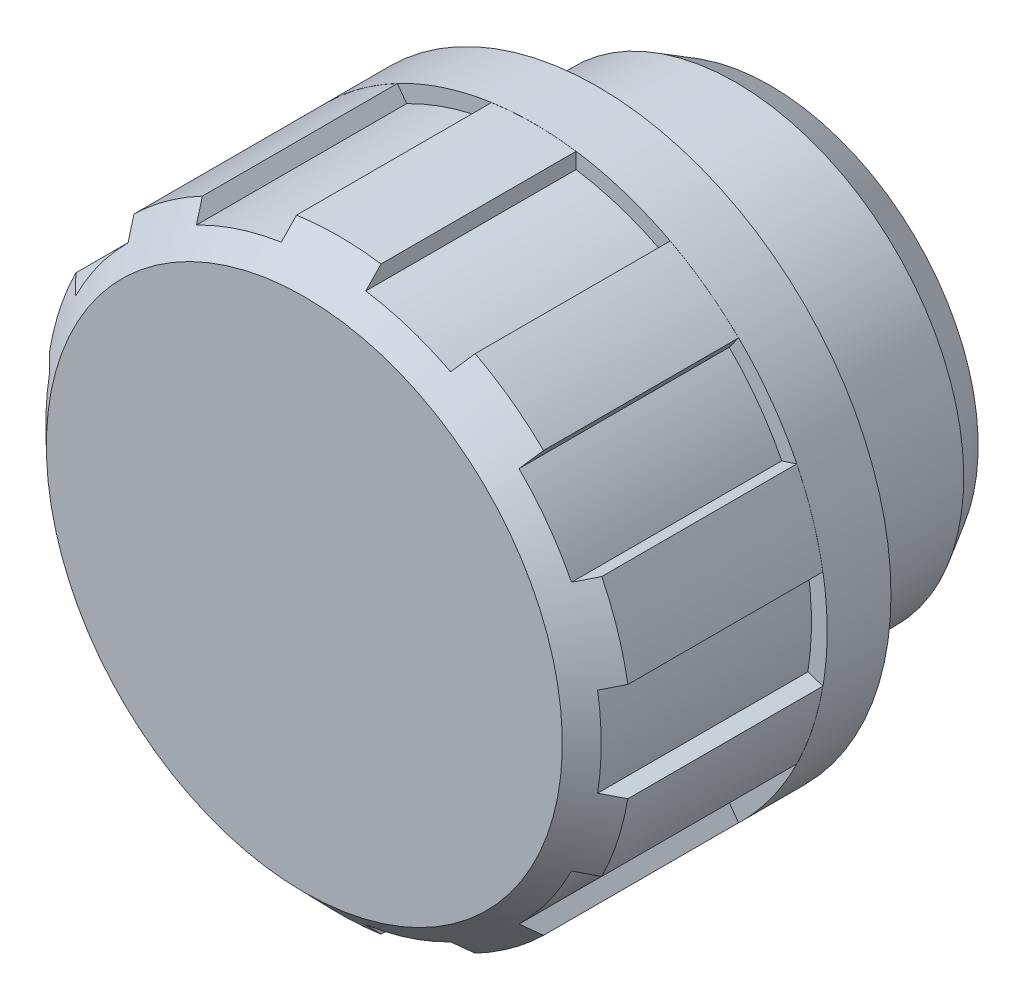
ISO-10303-21;
HEADER;
FILE_DESCRIPTION(('STEP AP214'),'2;1');
FILE_NAME('part.step','',(''),(''),'','','');
FILE_SCHEMA(('AUTOMOTIVE_DESIGN { 1 0 10303 214 1 1 1 1 }'));
ENDSEC;
DATA;
#1=APPLICATION_CONTEXT('core data for automotive mechanical design processes');
#2=APPLICATION_PROTOCOL_DEFINITION('international standard','automotive_design',2000,#1);
#3=PRODUCT_CONTEXT('',#1,'mechanical');
#4=PRODUCT('Part','Part','',(#3));
#5=PRODUCT_RELATED_PRODUCT_CATEGORY('part','',(#4));
#6=PRODUCT_DEFINITION_FORMATION('','',#4);
#7=PRODUCT_DEFINITION_CONTEXT('part definition',#1,'design');
#8=PRODUCT_DEFINITION('design','',#6,#7);
#9=PRODUCT_DEFINITION_SHAPE('','',#8);
#10=(LENGTH_UNIT() NAMED_UNIT(*) SI_UNIT(.MILLI.,.METRE.));
#11=(NAMED_UNIT(*) PLANE_ANGLE_UNIT() SI_UNIT($,.RADIAN.));
#12=(NAMED_UNIT(*) SI_UNIT($,.STERADIAN.) SOLID_ANGLE_UNIT());
#13=UNCERTAINTY_MEASURE_WITH_UNIT(LENGTH_MEASURE(1.E-05),#10,'distance_accuracy_value','');
#14=(GEOMETRIC_REPRESENTATION_CONTEXT(3) GLOBAL_UNCERTAINTY_ASSIGNED_CONTEXT((#13)) GLOBAL_UNIT_ASSIGNED_CONTEXT((#10,
#11,#12)) REPRESENTATION_CONTEXT('',''));
#15=CARTESIAN_POINT('',(0.,0.,0.));
#16=DIRECTION('',(0.,0.,1.));
#17=DIRECTION('',(1.,0.,0.));
#18=AXIS2_PLACEMENT_3D('',#15,#16,#17);
#19=CARTESIAN_POINT('',(0.,0.,-9.99949999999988));
#20=DIRECTION('',(0.,0.,-1.));
#21=DIRECTION('',(0.,1.,0.));
#22=AXIS2_PLACEMENT_3D('',#19,#20,#21);
#23=CYLINDRICAL_SURFACE('',#22,17.0028476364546);
#24=CARTESIAN_POINT('',(0.,0.,0.));
#25=DIRECTION('',(0.,0.,-1.));
#26=DIRECTION('',(0.,1.,0.));
#27=AXIS2_PLACEMENT_3D('',#24,#25,#26);
#28=CIRCLE('',#27,17.0028476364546);
#29=CARTESIAN_POINT('',(0.,17.0028476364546,0.));
#30=VERTEX_POINT('',#29);
#31=EDGE_CURVE('E528',#30,#30,#28,.T.);
#32=ORIENTED_EDGE('',*,*,#31,.F.);
#33=EDGE_LOOP('',(#32));
#34=FACE_BOUND('',#33,.T.);
#35=CARTESIAN_POINT('',(0.,0.,3.70000000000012));
#36=DIRECTION('',(0.,0.,1.));
#37=DIRECTION('',(0.,-1.,0.));
#38=AXIS2_PLACEMENT_3D('',#35,#36,#37);
#39=CIRCLE('',#38,17.0028476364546);
#40=CARTESIAN_POINT('',(0.,-17.0028476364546,3.70000000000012));
#41=VERTEX_POINT('',#40);
#42=EDGE_CURVE('E403',#41,#41,#39,.F.);
#43=ORIENTED_EDGE('',*,*,#42,.T.);
#44=EDGE_LOOP('',(#43));
#45=FACE_BOUND('',#44,.T.);
#46=ADVANCED_FACE('F14',(#34,#45),#23,.T.);
#47=CARTESIAN_POINT('',(13.2204999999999,0.,0.));
#48=DIRECTION('',(0.,0.,-1.));
#49=DIRECTION('',(0.,1.,0.));
#50=AXIS2_PLACEMENT_3D('',#47,#48,#49);
#51=PLANE('',#50);
#52=ORIENTED_EDGE('',*,*,#31,.T.);
#53=EDGE_LOOP('',(#52));
#54=FACE_BOUND('',#53,.T.);
#55=CARTESIAN_POINT('',(0.,0.,0.));
#56=DIRECTION('',(0.,0.,-1.));
#57=DIRECTION('',(0.,1.,0.));
#58=AXIS2_PLACEMENT_3D('',#55,#56,#57);
#59=CIRCLE('',#58,13.2204999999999);
#60=CARTESIAN_POINT('',(0.,13.2204999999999,0.));
#61=VERTEX_POINT('',#60);
#62=EDGE_CURVE('E525',#61,#61,#59,.T.);
#63=ORIENTED_EDGE('',*,*,#62,.F.);
#64=EDGE_LOOP('',(#63));
#65=FACE_BOUND('',#64,.T.);
#66=ADVANCED_FACE('F568',(#54,#65),#51,.T.);
#67=CARTESIAN_POINT('',(0.,0.,-9.99949999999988));
#68=DIRECTION('',(0.,0.,-1.));
#69=DIRECTION('',(0.,1.,0.));
#70=AXIS2_PLACEMENT_3D('',#67,#68,#69);
#71=CYLINDRICAL_SURFACE('',#70,13.2204999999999);
#72=ORIENTED_EDGE('',*,*,#62,.T.);
#73=EDGE_LOOP('',(#72));
#74=FACE_BOUND('',#73,.T.);
#75=CARTESIAN_POINT('',(0.,0.,-7.99949999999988));
#76=DIRECTION('',(0.,0.,-1.));
#77=DIRECTION('',(0.,1.,0.));
#78=AXIS2_PLACEMENT_3D('',#75,#76,#77);
#79=CIRCLE('',#78,13.2204999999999);
#80=CARTESIAN_POINT('',(0.,13.2204999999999,-7.99949999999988));
#81=VERTEX_POINT('',#80);
#82=EDGE_CURVE('E522',#81,#81,#79,.T.);
#83=ORIENTED_EDGE('',*,*,#82,.F.);
#84=EDGE_LOOP('',(#83));
#85=FACE_BOUND('',#84,.T.);
#86=ADVANCED_FACE('F564',(#74,#85),#71,.T.);
#87=CARTESIAN_POINT('',(0.,0.,-9.99949999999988));
#88=DIRECTION('',(0.,0.,1.));
#89=DIRECTION('',(0.,-1.,0.));
#90=AXIS2_PLACEMENT_3D('',#87,#88,#89);
#91=CONICAL_SURFACE('',#90,12.0585,0.526331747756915);
#92=ORIENTED_EDGE('',*,*,#82,.T.);
#93=EDGE_LOOP('',(#92));
#94=FACE_BOUND('',#93,.T.);
#95=CARTESIAN_POINT('',(0.,0.,-9.99949999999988));
#96=DIRECTION('',(0.,0.,-1.));
#97=DIRECTION('',(0.,1.,0.));
#98=AXIS2_PLACEMENT_3D('',#95,#96,#97);
#99=CIRCLE('',#98,12.0585);
#100=CARTESIAN_POINT('',(0.,12.0585,-9.99949999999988));
#101=VERTEX_POINT('',#100);
#102=EDGE_CURVE('E519',#101,#101,#99,.T.);
#103=ORIENTED_EDGE('',*,*,#102,.F.);
#104=EDGE_LOOP('',(#103));
#105=FACE_BOUND('',#104,.T.);
#106=ADVANCED_FACE('F560',(#94,#105),#91,.T.);
#107=CARTESIAN_POINT('',(0.,0.,-9.99949999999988));
#108=DIRECTION('',(0.,0.,-1.));
#109=DIRECTION('',(0.,1.,0.));
#110=AXIS2_PLACEMENT_3D('',#107,#108,#109);
#111=PLANE('',#110);
#112=ORIENTED_EDGE('',*,*,#102,.T.);
#113=EDGE_LOOP('',(#112));
#114=FACE_BOUND('',#113,.T.);
#115=ADVANCED_FACE('F553',(#114),#111,.T.);
#116=CARTESIAN_POINT('',(0.,0.,3.70000000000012));
#117=DIRECTION('',(0.,0.,1.));
#118=DIRECTION('',(0.,-1.,0.));
#119=AXIS2_PLACEMENT_3D('',#116,#117,#118);
#120=PLANE('',#119);
#121=ORIENTED_EDGE('',*,*,#42,.F.);
#122=EDGE_LOOP('',(#121));
#123=FACE_BOUND('',#122,.T.);
#124=DIRECTION('',(0.951056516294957,0.309016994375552,0.));
#125=VECTOR('',#124,1.);
#126=CARTESIAN_POINT('',(-14.3719538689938,-7.24581333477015,3.70000000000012));
#127=LINE('',#126,#125);
#128=CARTESIAN_POINT('',(-15.2420846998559,-7.52853598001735,3.70000000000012));
#129=VERTEX_POINT('',#128);
#130=CARTESIAN_POINT('',(-14.3719538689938,-7.24581333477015,3.70000000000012));
#131=VERTEX_POINT('',#130);
#132=EDGE_CURVE('E276',#129,#131,#127,.T.);
#133=ORIENTED_EDGE('',*,*,#132,.F.);
#134=CARTESIAN_POINT('',(0.,0.,3.70000000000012));
#135=DIRECTION('',(0.,0.,1.));
#136=DIRECTION('',(0.,-1.,0.));
#137=AXIS2_PLACEMENT_3D('',#134,#135,#136);
#138=CIRCLE('',#137,17.);
#139=CARTESIAN_POINT('',(-16.7562679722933,-2.86835905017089,3.70000000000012));
#140=VERTEX_POINT('',#139);
#141=EDGE_CURVE('E398',#140,#129,#138,.T.);
#142=ORIENTED_EDGE('',*,*,#141,.F.);
#143=DIRECTION('',(-0.951056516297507,-0.309016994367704,0.));
#144=VECTOR('',#143,1.);
#145=CARTESIAN_POINT('',(-15.8861371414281,-2.58563640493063,3.70000000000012));
#146=LINE('',#145,#144);
#147=CARTESIAN_POINT('',(-15.8861371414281,-2.58563640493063,3.70000000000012));
#148=VERTEX_POINT('',#147);
#149=EDGE_CURVE('E395',#148,#140,#146,.T.);
#150=ORIENTED_EDGE('',*,*,#149,.F.);
#151=CARTESIAN_POINT('',(0.,0.,3.70000000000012));
#152=DIRECTION('',(0.,0.,1.));
#153=DIRECTION('',(0.,-1.,0.));
#154=AXIS2_PLACEMENT_3D('',#151,#152,#153);
#155=CIRCLE('',#154,16.0951815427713);
#156=CARTESIAN_POINT('',(-15.8861371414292,2.58563640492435,3.70000000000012));
#157=VERTEX_POINT('',#156);
#158=EDGE_CURVE('E392',#157,#148,#155,.T.);
#159=ORIENTED_EDGE('',*,*,#158,.F.);
#160=DIRECTION('',(0.951056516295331,-0.309016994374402,0.));
#161=VECTOR('',#160,1.);
#162=CARTESIAN_POINT('',(-15.8861371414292,2.58563640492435,3.70000000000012));
#163=LINE('',#162,#161);
#164=CARTESIAN_POINT('',(-16.7562679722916,2.86835905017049,3.70000000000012));
#165=VERTEX_POINT('',#164);
#166=EDGE_CURVE('E389',#165,#157,#163,.T.);
#167=ORIENTED_EDGE('',*,*,#166,.F.);
#168=CARTESIAN_POINT('',(0.,0.,3.70000000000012));
#169=DIRECTION('',(0.,0.,1.));
#170=DIRECTION('',(0.,-1.,0.));
#171=AXIS2_PLACEMENT_3D('',#168,#169,#170);
#172=CIRCLE('',#171,16.9999999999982);
#173=CARTESIAN_POINT('',(-15.2420846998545,7.52853598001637,3.70000000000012));
#174=VERTEX_POINT('',#173);
#175=EDGE_CURVE('E386',#174,#165,#172,.T.);
#176=ORIENTED_EDGE('',*,*,#175,.F.);
#177=DIRECTION('',(-0.951056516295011,0.309016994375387,0.));
#178=VECTOR('',#177,1.);
#179=CARTESIAN_POINT('',(-14.3719538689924,7.24581333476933,3.70000000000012));
#180=LINE('',#179,#178);
#181=CARTESIAN_POINT('',(-14.3719538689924,7.24581333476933,3.70000000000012));
#182=VERTEX_POINT('',#181);
#183=EDGE_CURVE('E383',#182,#174,#180,.T.);
#184=ORIENTED_EDGE('',*,*,#183,.F.);
#185=CARTESIAN_POINT('',(0.,0.,3.70000000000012));
#186=DIRECTION('',(0.,0.,1.));
#187=DIRECTION('',(0.,-1.,0.));
#188=AXIS2_PLACEMENT_3D('',#185,#186,#187);
#189=CIRCLE('',#188,16.0951815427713);
#190=CARTESIAN_POINT('',(-11.3323559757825,11.4294609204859,3.70000000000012));
#191=VERTEX_POINT('',#190);
#192=EDGE_CURVE('E380',#191,#182,#189,.T.);
#193=ORIENTED_EDGE('',*,*,#192,.F.);
#194=DIRECTION('',(0.587785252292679,-0.809016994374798,0.));
#195=VECTOR('',#194,1.);
#196=CARTESIAN_POINT('',(-11.3323559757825,11.4294609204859,3.70000000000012));
#197=LINE('',#196,#195);
#198=CARTESIAN_POINT('',(-11.8701264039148,12.1696384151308,3.70000000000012));
#199=VERTEX_POINT('',#198);
#200=EDGE_CURVE('E377',#199,#191,#197,.T.);
#201=ORIENTED_EDGE('',*,*,#200,.F.);
#202=CARTESIAN_POINT('',(0.,0.,3.70000000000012));
#203=DIRECTION('',(0.,0.,1.));
#204=DIRECTION('',(0.,-1.,0.));
#205=AXIS2_PLACEMENT_3D('',#202,#203,#204);
#206=CIRCLE('',#205,16.9999999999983);
#207=CARTESIAN_POINT('',(-7.90594313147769,15.0497861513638,3.70000000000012));
#208=VERTEX_POINT('',#207);
#209=EDGE_CURVE('E374',#208,#199,#206,.T.);
#210=ORIENTED_EDGE('',*,*,#209,.F.);
#211=DIRECTION('',(-0.587785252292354,0.809016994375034,0.));
#212=VECTOR('',#211,1.);
#213=CARTESIAN_POINT('',(-7.36817270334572,14.3096086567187,3.70000000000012));
#214=LINE('',#213,#212);
#215=CARTESIAN_POINT('',(-7.36817270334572,14.3096086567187,3.70000000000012));
#216=VERTEX_POINT('',#215);
#217=EDGE_CURVE('E371',#216,#208,#214,.T.);
#218=ORIENTED_EDGE('',*,*,#217,.F.);
#219=CARTESIAN_POINT('',(0.,0.,3.70000000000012));
#220=DIRECTION('',(0.,0.,1.));
#221=DIRECTION('',(0.,-1.,0.));
#222=AXIS2_PLACEMENT_3D('',#219,#220,#221);
#223=CIRCLE('',#222,16.0951815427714);
#224=CARTESIAN_POINT('',(-2.44999999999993,15.9076198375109,3.70000000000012));
#225=VERTEX_POINT('',#224);
#226=EDGE_CURVE('E368',#225,#216,#223,.T.);
#227=ORIENTED_EDGE('',*,*,#226,.F.);
#228=DIRECTION('',(0.,-1.,0.));
#229=VECTOR('',#228,1.);
#230=CARTESIAN_POINT('',(-2.44999999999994,15.9076198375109,3.70000000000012));
#231=LINE('',#230,#229);
#232=CARTESIAN_POINT('',(-2.44999999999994,16.8225295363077,3.70000000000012));
#233=VERTEX_POINT('',#232);
#234=EDGE_CURVE('E365',#233,#225,#231,.T.);
#235=ORIENTED_EDGE('',*,*,#234,.F.);
#236=CARTESIAN_POINT('',(0.,0.,3.70000000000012));
#237=DIRECTION('',(0.,0.,1.));
#238=DIRECTION('',(0.,-1.,0.));
#239=AXIS2_PLACEMENT_3D('',#236,#237,#238);
#240=CIRCLE('',#239,16.9999999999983);
#241=CARTESIAN_POINT('',(2.44999999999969,16.8225295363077,3.70000000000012));
#242=VERTEX_POINT('',#241);
#243=EDGE_CURVE('E362',#242,#233,#240,.T.);
#244=ORIENTED_EDGE('',*,*,#243,.F.);
#245=DIRECTION('',(0.,1.,0.));
#246=VECTOR('',#245,1.);
#247=CARTESIAN_POINT('',(2.44999999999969,15.9076198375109,3.70000000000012));
#248=LINE('',#247,#246);
#249=CARTESIAN_POINT('',(2.44999999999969,15.9076198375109,3.70000000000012));
#250=VERTEX_POINT('',#249);
#251=EDGE_CURVE('E359',#250,#242,#248,.T.);
#252=ORIENTED_EDGE('',*,*,#251,.F.);
#253=CARTESIAN_POINT('',(0.,0.,3.70000000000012));
#254=DIRECTION('',(0.,0.,1.));
#255=DIRECTION('',(0.,-1.,0.));
#256=AXIS2_PLACEMENT_3D('',#253,#254,#255);
#257=CIRCLE('',#256,16.0951815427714);
#258=CARTESIAN_POINT('',(7.3681727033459,14.3096086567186,3.70000000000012));
#259=VERTEX_POINT('',#258);
#260=EDGE_CURVE('E356',#259,#250,#257,.T.);
#261=ORIENTED_EDGE('',*,*,#260,.F.);
#262=DIRECTION('',(-0.587785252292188,-0.809016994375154,0.));
#263=VECTOR('',#262,1.);
#264=CARTESIAN_POINT('',(7.3681727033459,14.3096086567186,3.70000000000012));
#265=LINE('',#264,#263);
#266=CARTESIAN_POINT('',(7.90594313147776,15.0497861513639,3.70000000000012));
#267=VERTEX_POINT('',#266);
#268=EDGE_CURVE('E353',#267,#259,#265,.T.);
#269=ORIENTED_EDGE('',*,*,#268,.F.);
#270=CARTESIAN_POINT('',(0.,0.,3.70000000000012));
#271=DIRECTION('',(0.,0.,1.));
#272=DIRECTION('',(0.,-1.,0.));
#273=AXIS2_PLACEMENT_3D('',#270,#271,#272);
#274=CIRCLE('',#273,16.9999999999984);
#275=CARTESIAN_POINT('',(11.8701264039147,12.169638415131,3.70000000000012));
#276=VERTEX_POINT('',#275);
#277=EDGE_CURVE('E350',#276,#267,#274,.T.);
#278=ORIENTED_EDGE('',*,*,#277,.F.);
#279=DIRECTION('',(0.587785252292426,0.809016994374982,0.));
#280=VECTOR('',#279,1.);
#281=CARTESIAN_POINT('',(11.3323559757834,11.429460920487,3.70000000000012));
#282=LINE('',#281,#280);
#283=CARTESIAN_POINT('',(11.3323559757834,11.429460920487,3.70000000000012));
#284=VERTEX_POINT('',#283);
#285=EDGE_CURVE('E347',#284,#276,#282,.T.);
#286=ORIENTED_EDGE('',*,*,#285,.F.);
#287=CARTESIAN_POINT('',(0.,0.,3.70000000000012));
#288=DIRECTION('',(0.,0.,1.));
#289=DIRECTION('',(0.,-1.,0.));
#290=AXIS2_PLACEMENT_3D('',#287,#288,#289);
#291=CIRCLE('',#290,16.0951815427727);
#292=CARTESIAN_POINT('',(14.3719538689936,7.24581333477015,3.70000000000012));
#293=VERTEX_POINT('',#292);
#294=EDGE_CURVE('E344',#293,#284,#291,.T.);
#295=ORIENTED_EDGE('',*,*,#294,.F.);
#296=DIRECTION('',(-0.951056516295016,-0.309016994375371,0.));
#297=VECTOR('',#296,1.);
#298=CARTESIAN_POINT('',(14.3719538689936,7.24581333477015,3.70000000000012));
#299=LINE('',#298,#297);
#300=CARTESIAN_POINT('',(15.2420846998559,7.52853598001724,3.70000000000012));
#301=VERTEX_POINT('',#300);
#302=EDGE_CURVE('E341',#301,#293,#299,.T.);
#303=ORIENTED_EDGE('',*,*,#302,.F.);
#304=CARTESIAN_POINT('',(0.,0.,3.70000000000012));
#305=DIRECTION('',(0.,0.,1.));
#306=DIRECTION('',(0.,-1.,0.));
#307=AXIS2_PLACEMENT_3D('',#304,#305,#306);
#308=CIRCLE('',#307,17.);
#309=CARTESIAN_POINT('',(16.7562679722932,2.86835905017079,3.70000000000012));
#310=VERTEX_POINT('',#309);
#311=EDGE_CURVE('E338',#310,#301,#308,.T.);
#312=ORIENTED_EDGE('',*,*,#311,.F.);
#313=DIRECTION('',(0.951056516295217,0.309016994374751,0.));
#314=VECTOR('',#313,1.);
#315=CARTESIAN_POINT('',(15.8861371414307,2.58563640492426,3.70000000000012));
#316=LINE('',#315,#314);
#317=CARTESIAN_POINT('',(15.8861371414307,2.58563640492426,3.70000000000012));
#318=VERTEX_POINT('',#317);
#319=EDGE_CURVE('E335',#318,#310,#316,.T.);
#320=ORIENTED_EDGE('',*,*,#319,.F.);
#321=CARTESIAN_POINT('',(0.,0.,3.70000000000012));
#322=DIRECTION('',(0.,0.,1.));
#323=DIRECTION('',(0.,-1.,0.));
#324=AXIS2_PLACEMENT_3D('',#321,#322,#323);
#325=CIRCLE('',#324,16.0951815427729);
#326=CARTESIAN_POINT('',(15.8861371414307,-2.5856364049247,3.70000000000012));
#327=VERTEX_POINT('',#326);
#328=EDGE_CURVE('E332',#327,#318,#325,.T.);
#329=ORIENTED_EDGE('',*,*,#328,.F.);
#330=DIRECTION('',(-0.951056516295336,0.309016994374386,0.));
#331=VECTOR('',#330,1.);
#332=CARTESIAN_POINT('',(15.8861371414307,-2.5856364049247,3.70000000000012));
#333=LINE('',#332,#331);
#334=CARTESIAN_POINT('',(16.7562679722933,-2.86835905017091,3.70000000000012));
#335=VERTEX_POINT('',#334);
#336=EDGE_CURVE('E329',#335,#327,#333,.T.);
#337=ORIENTED_EDGE('',*,*,#336,.F.);
#338=CARTESIAN_POINT('',(0.,0.,3.70000000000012));
#339=DIRECTION('',(0.,0.,1.));
#340=DIRECTION('',(0.,-1.,0.));
#341=AXIS2_PLACEMENT_3D('',#338,#339,#340);
#342=CIRCLE('',#341,17.);
#343=CARTESIAN_POINT('',(15.2420846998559,-7.52853598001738,3.70000000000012));
#344=VERTEX_POINT('',#343);
#345=EDGE_CURVE('E326',#344,#335,#342,.T.);
#346=ORIENTED_EDGE('',*,*,#345,.F.);
#347=DIRECTION('',(0.951056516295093,-0.309016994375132,0.));
#348=VECTOR('',#347,1.);
#349=CARTESIAN_POINT('',(14.3719538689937,-7.24581333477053,3.70000000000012));
#350=LINE('',#349,#348);
#351=CARTESIAN_POINT('',(14.3719538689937,-7.24581333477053,3.70000000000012));
#352=VERTEX_POINT('',#351);
#353=EDGE_CURVE('E323',#352,#344,#350,.T.);
#354=ORIENTED_EDGE('',*,*,#353,.F.);
#355=CARTESIAN_POINT('',(0.,0.,3.70000000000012));
#356=DIRECTION('',(0.,0.,1.));
#357=DIRECTION('',(0.,-1.,0.));
#358=AXIS2_PLACEMENT_3D('',#355,#356,#357);
#359=CIRCLE('',#358,16.095181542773);
#360=CARTESIAN_POINT('',(11.3323559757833,-11.4294609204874,3.70000000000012));
#361=VERTEX_POINT('',#360);
#362=EDGE_CURVE('E320',#361,#352,#359,.T.);
#363=ORIENTED_EDGE('',*,*,#362,.F.);
#364=DIRECTION('',(-0.587785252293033,0.809016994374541,0.));
#365=VECTOR('',#364,1.);
#366=CARTESIAN_POINT('',(11.3323559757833,-11.4294609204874,3.70000000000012));
#367=LINE('',#366,#365);
#368=CARTESIAN_POINT('',(11.8701264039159,-12.1696384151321,3.70000000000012));
#369=VERTEX_POINT('',#368);
#370=EDGE_CURVE('E317',#369,#361,#367,.T.);
#371=ORIENTED_EDGE('',*,*,#370,.F.);
#372=CARTESIAN_POINT('',(0.,0.,3.70000000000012));
#373=DIRECTION('',(0.,0.,1.));
#374=DIRECTION('',(0.,-1.,0.));
#375=AXIS2_PLACEMENT_3D('',#372,#373,#374);
#376=CIRCLE('',#375,17.);
#377=CARTESIAN_POINT('',(7.90594313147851,-15.0497861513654,3.70000000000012));
#378=VERTEX_POINT('',#377);
#379=EDGE_CURVE('E314',#378,#369,#376,.T.);
#380=ORIENTED_EDGE('',*,*,#379,.F.);
#381=DIRECTION('',(0.587785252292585,-0.809016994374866,0.));
#382=VECTOR('',#381,1.);
#383=CARTESIAN_POINT('',(7.368172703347,-14.3096086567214,3.70000000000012));
#384=LINE('',#383,#382);
#385=CARTESIAN_POINT('',(7.368172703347,-14.3096086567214,3.70000000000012));
#386=VERTEX_POINT('',#385);
#387=EDGE_CURVE('E311',#386,#378,#384,.T.);
#388=ORIENTED_EDGE('',*,*,#387,.F.);
#389=CARTESIAN_POINT('',(0.,0.,3.70000000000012));
#390=DIRECTION('',(0.,0.,1.));
#391=DIRECTION('',(0.,-1.,0.));
#392=AXIS2_PLACEMENT_3D('',#389,#390,#391);
#393=CIRCLE('',#392,16.0951815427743);
#394=CARTESIAN_POINT('',(2.44999999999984,-15.9076198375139,3.70000000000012));
#395=VERTEX_POINT('',#394);
#396=EDGE_CURVE('E308',#395,#386,#393,.T.);
#397=ORIENTED_EDGE('',*,*,#396,.F.);
#398=DIRECTION('',(-3.64043476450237E-13,1.,0.));
#399=VECTOR('',#398,1.);
#400=CARTESIAN_POINT('',(2.44999999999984,-15.9076198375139,3.70000000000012));
#401=LINE('',#400,#399);
#402=CARTESIAN_POINT('',(2.45000000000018,-16.8225295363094,3.70000000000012));
#403=VERTEX_POINT('',#402);
#404=EDGE_CURVE('E305',#403,#395,#401,.T.);
#405=ORIENTED_EDGE('',*,*,#404,.F.);
#406=CARTESIAN_POINT('',(0.,0.,3.70000000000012));
#407=DIRECTION('',(0.,0.,1.));
#408=DIRECTION('',(0.,-1.,0.));
#409=AXIS2_PLACEMENT_3D('',#406,#407,#408);
#410=CIRCLE('',#409,17.);
#411=CARTESIAN_POINT('',(-2.45000000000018,-16.8225295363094,3.70000000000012));
#412=VERTEX_POINT('',#411);
#413=EDGE_CURVE('E302',#412,#403,#410,.T.);
#414=ORIENTED_EDGE('',*,*,#413,.F.);
#415=DIRECTION('',(-1.2134782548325E-13,-1.,0.));
#416=VECTOR('',#415,1.);
#417=CARTESIAN_POINT('',(-2.45000000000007,-15.9076198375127,3.70000000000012));
#418=LINE('',#417,#416);
#419=CARTESIAN_POINT('',(-2.45000000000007,-15.9076198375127,3.70000000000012));
#420=VERTEX_POINT('',#419);
#421=EDGE_CURVE('E299',#420,#412,#418,.T.);
#422=ORIENTED_EDGE('',*,*,#421,.F.);
#423=CARTESIAN_POINT('',(0.,0.,3.70000000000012));
#424=DIRECTION('',(0.,0.,1.));
#425=DIRECTION('',(0.,-1.,0.));
#426=AXIS2_PLACEMENT_3D('',#423,#424,#425);
#427=CIRCLE('',#426,16.0951815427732);
#428=CARTESIAN_POINT('',(-7.36817270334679,-14.3096086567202,3.70000000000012));
#429=VERTEX_POINT('',#428);
#430=EDGE_CURVE('E296',#429,#420,#427,.T.);
#431=ORIENTED_EDGE('',*,*,#430,.F.);
#432=DIRECTION('',(0.587785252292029,0.80901699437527,0.));
#433=VECTOR('',#432,1.);
#434=CARTESIAN_POINT('',(-7.36817270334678,-14.3096086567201,3.70000000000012));
#435=LINE('',#434,#433);
#436=CARTESIAN_POINT('',(-7.90594313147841,-15.0497861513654,3.70000000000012));
#437=VERTEX_POINT('',#436);
#438=EDGE_CURVE('E293',#437,#429,#435,.T.);
#439=ORIENTED_EDGE('',*,*,#438,.F.);
#440=CARTESIAN_POINT('',(0.,0.,3.70000000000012));
#441=DIRECTION('',(0.,0.,1.));
#442=DIRECTION('',(0.,-1.,0.));
#443=AXIS2_PLACEMENT_3D('',#440,#441,#442);
#444=CIRCLE('',#443,17.);
#445=CARTESIAN_POINT('',(-11.8701264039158,-12.1696384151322,3.70000000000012));
#446=VERTEX_POINT('',#445);
#447=EDGE_CURVE('E286',#446,#437,#444,.T.);
#448=ORIENTED_EDGE('',*,*,#447,.F.);
#449=DIRECTION('',(-0.587785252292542,-0.809016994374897,0.));
#450=VECTOR('',#449,1.);
#451=CARTESIAN_POINT('',(-11.3323559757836,-11.4294609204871,3.70000000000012));
#452=LINE('',#451,#450);
#453=CARTESIAN_POINT('',(-11.3323559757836,-11.4294609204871,3.70000000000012));
#454=VERTEX_POINT('',#453);
#455=EDGE_CURVE('E272',#454,#446,#452,.T.);
#456=ORIENTED_EDGE('',*,*,#455,.F.);
#457=CARTESIAN_POINT('',(0.,0.,3.70000000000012));
#458=DIRECTION('',(0.,0.,1.));
#459=DIRECTION('',(0.,-1.,0.));
#460=AXIS2_PLACEMENT_3D('',#457,#458,#459);
#461=CIRCLE('',#460,16.0951815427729);
#462=EDGE_CURVE('E282',#131,#454,#461,.T.);
#463=ORIENTED_EDGE('',*,*,#462,.F.);
#464=EDGE_LOOP('',(#133,#142,#150,#159,#167,#176,#184,#193,#201,#210,#218,#227,#235,#244,#252,
#261,#269,#278,#286,#295,#303,#312,#320,#329,#337,#346,#354,#363,#371,#380,#388,#397,#405,#414,
#422,#431,#439,#448,#456,#463));
#465=FACE_BOUND('',#464,.T.);
#466=ADVANCED_FACE('F281',(#123,#465),#120,.T.);
#467=CARTESIAN_POINT('',(0.,0.,3.70000000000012));
#468=DIRECTION('',(0.,0.,1.));
#469=DIRECTION('',(0.,-1.,0.));
#470=AXIS2_PLACEMENT_3D('',#467,#468,#469);
#471=CYLINDRICAL_SURFACE('',#470,16.0951815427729);
#472=DIRECTION('',(0.,0.,1.));
#473=VECTOR('',#472,1.);
#474=CARTESIAN_POINT('',(-14.3719538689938,-7.24581333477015,3.70000000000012));
#475=LINE('',#474,#473);
#476=CARTESIAN_POINT('',(-14.3719538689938,-7.24581333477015,15.885527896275));
#477=VERTEX_POINT('',#476);
#478=EDGE_CURVE('E289',#131,#477,#475,.T.);
#479=ORIENTED_EDGE('',*,*,#478,.F.);
#480=ORIENTED_EDGE('',*,*,#462,.T.);
#481=DIRECTION('',(0.,0.,1.));
#482=VECTOR('',#481,1.);
#483=CARTESIAN_POINT('',(-11.3323559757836,-11.4294609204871,3.70000000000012));
#484=LINE('',#483,#482);
#485=CARTESIAN_POINT('',(-11.3323559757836,-11.4294609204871,15.8855278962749));
#486=VERTEX_POINT('',#485);
#487=EDGE_CURVE('E269',#454,#486,#484,.T.);
#488=ORIENTED_EDGE('',*,*,#487,.T.);
#489=CARTESIAN_POINT('',(0.,0.,15.885527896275));
#490=DIRECTION('',(0.,0.,-1.));
#491=DIRECTION('',(0.,1.,0.));
#492=AXIS2_PLACEMENT_3D('',#489,#490,#491);
#493=CIRCLE('',#492,16.0951815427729);
#494=EDGE_CURVE('E9',#477,#486,#493,.F.);
#495=ORIENTED_EDGE('',*,*,#494,.F.);
#496=EDGE_LOOP('',(#479,#480,#488,#495));
#497=FACE_BOUND('',#496,.T.);
#498=ADVANCED_FACE('F288',(#497),#471,.T.);
#499=CARTESIAN_POINT('',(-14.3719538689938,-7.24581333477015,3.70000000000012));
#500=DIRECTION('',(0.309016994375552,-0.951056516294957,0.));
#501=DIRECTION('',(0.951056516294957,0.309016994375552,0.));
#502=AXIS2_PLACEMENT_3D('',#499,#500,#501);
#503=PLANE('',#502);
#504=DIRECTION('',(0.,0.,1.));
#505=VECTOR('',#504,1.);
#506=CARTESIAN_POINT('',(-15.2420846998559,-7.52853598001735,3.70000000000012));
#507=LINE('',#506,#505);
#508=CARTESIAN_POINT('',(-15.2420846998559,-7.52853598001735,15.0027781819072));
#509=VERTEX_POINT('',#508);
#510=EDGE_CURVE('E404',#129,#509,#507,.T.);
#511=ORIENTED_EDGE('',*,*,#510,.F.);
#512=ORIENTED_EDGE('',*,*,#132,.T.);
#513=ORIENTED_EDGE('',*,*,#478,.T.);
#514=CARTESIAN_POINT('',(-15.2422846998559,-7.5286009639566,15.0025751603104));
#515=CARTESIAN_POINT('',(-15.0972391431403,-7.48147280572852,15.1498145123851));
#516=CARTESIAN_POINT('',(-14.9521721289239,-7.43433767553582,15.2970304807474));
#517=CARTESIAN_POINT('',(-14.6619951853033,-7.34005347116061,15.5914156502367));
#518=CARTESIAN_POINT('',(-14.5168852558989,-7.29290439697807,15.7385848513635));
#519=CARTESIAN_POINT('',(-14.3717538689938,-7.2457483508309,15.885730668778));
#520=B_SPLINE_CURVE_WITH_KNOTS('',3,(#514,#515,#516,#517,#518,#519),.UNSPECIFIED.,.F.,.F.,(4,2,
4),(0.,0.635962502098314,1.27192500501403),.UNSPECIFIED.);
#521=EDGE_CURVE('E23',#509,#477,#520,.T.);
#522=ORIENTED_EDGE('',*,*,#521,.F.);
#523=EDGE_LOOP('',(#511,#512,#513,#522));
#524=FACE_BOUND('',#523,.T.);
#525=ADVANCED_FACE('F550',(#524),#503,.T.);
#526=CARTESIAN_POINT('',(0.,0.,3.70000000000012));
#527=DIRECTION('',(0.,0.,1.));
#528=DIRECTION('',(0.,-1.,0.));
#529=AXIS2_PLACEMENT_3D('',#526,#527,#528);
#530=CYLINDRICAL_SURFACE('',#529,17.);
#531=DIRECTION('',(0.,0.,1.));
#532=VECTOR('',#531,1.);
#533=CARTESIAN_POINT('',(-16.7562679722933,-2.86835905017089,3.70000000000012));
#534=LINE('',#533,#532);
#535=CARTESIAN_POINT('',(-16.7562679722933,-2.86835905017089,15.0027781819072));
#536=VERTEX_POINT('',#535);
#537=EDGE_CURVE('E407',#140,#536,#534,.T.);
#538=ORIENTED_EDGE('',*,*,#537,.F.);
#539=ORIENTED_EDGE('',*,*,#141,.T.);
#540=ORIENTED_EDGE('',*,*,#510,.T.);
#541=CARTESIAN_POINT('',(0.,0.,15.0027781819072));
#542=DIRECTION('',(0.,0.,-1.));
#543=DIRECTION('',(0.,1.,0.));
#544=AXIS2_PLACEMENT_3D('',#541,#542,#543);
#545=CIRCLE('',#544,17.);
#546=EDGE_CURVE('E1034',#536,#509,#545,.F.);
#547=ORIENTED_EDGE('',*,*,#546,.F.);
#548=EDGE_LOOP('',(#538,#539,#540,#547));
#549=FACE_BOUND('',#548,.T.);
#550=ADVANCED_FACE('F629',(#549),#530,.T.);
#551=CARTESIAN_POINT('',(-15.8861371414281,-2.58563640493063,3.70000000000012));
#552=DIRECTION('',(-0.309016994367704,0.951056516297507,0.));
#553=DIRECTION('',(-0.951056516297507,-0.309016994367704,0.));
#554=AXIS2_PLACEMENT_3D('',#551,#552,#553);
#555=PLANE('',#554);
#556=DIRECTION('',(0.,0.,1.));
#557=VECTOR('',#556,1.);
#558=CARTESIAN_POINT('',(-15.8861371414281,-2.58563640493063,3.70000000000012));
#559=LINE('',#558,#557);
#560=CARTESIAN_POINT('',(-15.8861371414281,-2.58563640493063,15.8855278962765));
#561=VERTEX_POINT('',#560);
#562=EDGE_CURVE('E410',#148,#561,#559,.T.);
#563=ORIENTED_EDGE('',*,*,#562,.F.);
#564=ORIENTED_EDGE('',*,*,#149,.T.);
#565=ORIENTED_EDGE('',*,*,#537,.T.);
#566=CARTESIAN_POINT('',(-15.8859371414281,-2.58557142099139,15.8857306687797));
#567=CARTESIAN_POINT('',(-16.0310685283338,-2.6327274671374,15.7385848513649));
#568=CARTESIAN_POINT('',(-16.1761784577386,-2.67987654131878,15.5914156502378));
#569=CARTESIAN_POINT('',(-16.4663554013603,-2.77416074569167,15.2970304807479));
#570=CARTESIAN_POINT('',(-16.6114224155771,-2.82129587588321,15.1498145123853));
#571=CARTESIAN_POINT('',(-16.7564679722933,-2.86842403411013,15.0025751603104));
#572=B_SPLINE_CURVE_WITH_KNOTS('',3,(#566,#567,#568,#569,#570,#571),.UNSPECIFIED.,.F.,.F.,(4,2,
4),(0.,0.635962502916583,1.27192500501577),.UNSPECIFIED.);
#573=EDGE_CURVE('E1035',#561,#536,#572,.T.);
#574=ORIENTED_EDGE('',*,*,#573,.F.);
#575=EDGE_LOOP('',(#563,#564,#565,#574));
#576=FACE_BOUND('',#575,.T.);
#577=ADVANCED_FACE('F638',(#576),#555,.T.);
#578=CARTESIAN_POINT('',(0.,0.,3.70000000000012));
#579=DIRECTION('',(0.,0.,1.));
#580=DIRECTION('',(0.,-1.,0.));
#581=AXIS2_PLACEMENT_3D('',#578,#579,#580);
#582=CYLINDRICAL_SURFACE('',#581,16.0951815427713);
#583=DIRECTION('',(0.,0.,1.));
#584=VECTOR('',#583,1.);
#585=CARTESIAN_POINT('',(-15.8861371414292,2.58563640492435,3.70000000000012));
#586=LINE('',#585,#584);
#587=CARTESIAN_POINT('',(-15.8861371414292,2.58563640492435,15.8855278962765));
#588=VERTEX_POINT('',#587);
#589=EDGE_CURVE('E413',#157,#588,#586,.T.);
#590=ORIENTED_EDGE('',*,*,#589,.F.);
#591=ORIENTED_EDGE('',*,*,#158,.T.);
#592=ORIENTED_EDGE('',*,*,#562,.T.);
#593=CARTESIAN_POINT('',(0.,0.,15.8855278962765));
#594=DIRECTION('',(0.,0.,-1.));
#595=DIRECTION('',(0.,1.,0.));
#596=AXIS2_PLACEMENT_3D('',#593,#594,#595);
#597=CIRCLE('',#596,16.0951815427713);
#598=EDGE_CURVE('E1049',#588,#561,#597,.F.);
#599=ORIENTED_EDGE('',*,*,#598,.F.);
#600=EDGE_LOOP('',(#590,#591,#592,#599));
#601=FACE_BOUND('',#600,.T.);
#602=ADVANCED_FACE('F647',(#601),#582,.T.);
#603=CARTESIAN_POINT('',(-15.8861371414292,2.58563640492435,3.70000000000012));
#604=DIRECTION('',(-0.309016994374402,-0.951056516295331,0.));
#605=DIRECTION('',(0.951056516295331,-0.309016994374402,0.));
#606=AXIS2_PLACEMENT_3D('',#603,#604,#605);
#607=PLANE('',#606);
#608=DIRECTION('',(0.,0.,1.));
#609=VECTOR('',#608,1.);
#610=CARTESIAN_POINT('',(-16.7562679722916,2.86835905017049,3.70000000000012));
#611=LINE('',#610,#609);
#612=CARTESIAN_POINT('',(-16.7562679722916,2.86835905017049,15.0027781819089));
#613=VERTEX_POINT('',#612);
#614=EDGE_CURVE('E416',#165,#613,#611,.T.);
#615=ORIENTED_EDGE('',*,*,#614,.F.);
#616=ORIENTED_EDGE('',*,*,#166,.T.);
#617=ORIENTED_EDGE('',*,*,#589,.T.);
#618=CARTESIAN_POINT('',(-16.7564679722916,2.86842403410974,15.0025751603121));
#619=CARTESIAN_POINT('',(-16.6114224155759,2.82129587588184,15.1498145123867));
#620=CARTESIAN_POINT('',(-16.4663554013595,2.77416074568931,15.2970304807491));
#621=CARTESIAN_POINT('',(-16.1761784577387,2.67987654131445,15.5914156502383));
#622=CARTESIAN_POINT('',(-16.0310685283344,2.63272746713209,15.7385848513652));
#623=CARTESIAN_POINT('',(-15.8859371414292,2.5855714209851,15.8857306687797));
#624=B_SPLINE_CURVE_WITH_KNOTS('',3,(#618,#619,#620,#621,#622,#623),.UNSPECIFIED.,.F.,.F.,(4,2,
4),(0.,0.635962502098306,1.27192500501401),.UNSPECIFIED.);
#625=EDGE_CURVE('E1052',#613,#588,#624,.T.);
#626=ORIENTED_EDGE('',*,*,#625,.F.);
#627=EDGE_LOOP('',(#615,#616,#617,#626));
#628=FACE_BOUND('',#627,.T.);
#629=ADVANCED_FACE('F656',(#628),#607,.T.);
#630=CARTESIAN_POINT('',(0.,0.,3.70000000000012));
#631=DIRECTION('',(0.,0.,1.));
#632=DIRECTION('',(0.,-1.,0.));
#633=AXIS2_PLACEMENT_3D('',#630,#631,#632);
#634=CYLINDRICAL_SURFACE('',#633,16.9999999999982);
#635=DIRECTION('',(0.,0.,1.));
#636=VECTOR('',#635,1.);
#637=CARTESIAN_POINT('',(-15.2420846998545,7.52853598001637,3.70000000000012));
#638=LINE('',#637,#636);
#639=CARTESIAN_POINT('',(-15.2420846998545,7.52853598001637,15.0027781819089));
#640=VERTEX_POINT('',#639);
#641=EDGE_CURVE('E419',#174,#640,#638,.T.);
#642=ORIENTED_EDGE('',*,*,#641,.F.);
#643=ORIENTED_EDGE('',*,*,#175,.T.);
#644=ORIENTED_EDGE('',*,*,#614,.T.);
#645=CARTESIAN_POINT('',(0.,0.,15.0027781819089));
#646=DIRECTION('',(0.,0.,-1.));
#647=DIRECTION('',(0.,1.,0.));
#648=AXIS2_PLACEMENT_3D('',#645,#646,#647);
#649=CIRCLE('',#648,16.9999999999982);
#650=EDGE_CURVE('E1059',#640,#613,#649,.F.);
#651=ORIENTED_EDGE('',*,*,#650,.F.);
#652=EDGE_LOOP('',(#642,#643,#644,#651));
#653=FACE_BOUND('',#652,.T.);
#654=ADVANCED_FACE('F665',(#653),#634,.T.);
#655=CARTESIAN_POINT('',(-14.3719538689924,7.24581333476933,3.70000000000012));
#656=DIRECTION('',(0.309016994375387,0.951056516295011,0.));
#657=DIRECTION('',(-0.951056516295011,0.309016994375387,0.));
#658=AXIS2_PLACEMENT_3D('',#655,#656,#657);
#659=PLANE('',#658);
#660=DIRECTION('',(0.,0.,1.));
#661=VECTOR('',#660,1.);
#662=CARTESIAN_POINT('',(-14.3719538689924,7.24581333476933,3.70000000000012));
#663=LINE('',#662,#661);
#664=CARTESIAN_POINT('',(-14.3719538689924,7.24581333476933,15.8855278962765));
#665=VERTEX_POINT('',#664);
#666=EDGE_CURVE('E422',#182,#665,#663,.T.);
#667=ORIENTED_EDGE('',*,*,#666,.F.);
#668=ORIENTED_EDGE('',*,*,#183,.T.);
#669=ORIENTED_EDGE('',*,*,#641,.T.);
#670=CARTESIAN_POINT('',(-14.3717538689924,7.24574835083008,15.8857306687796));
#671=CARTESIAN_POINT('',(-14.5168852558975,7.29290439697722,15.7385848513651));
#672=CARTESIAN_POINT('',(-14.6619951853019,7.34005347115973,15.5914156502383));
#673=CARTESIAN_POINT('',(-14.9521721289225,7.43433767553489,15.2970304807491));
#674=CARTESIAN_POINT('',(-15.0972391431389,7.48147280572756,15.1498145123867));
#675=CARTESIAN_POINT('',(-15.2422846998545,7.52860096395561,15.0025751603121));
#676=B_SPLINE_CURVE_WITH_KNOTS('',3,(#670,#671,#672,#673,#674,#675),.UNSPECIFIED.,.F.,.F.,(4,2,
4),(0.,0.63596250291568,1.27192500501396),.UNSPECIFIED.);
#677=EDGE_CURVE('E1063',#665,#640,#676,.T.);
#678=ORIENTED_EDGE('',*,*,#677,.F.);
#679=EDGE_LOOP('',(#667,#668,#669,#678));
#680=FACE_BOUND('',#679,.T.);
#681=ADVANCED_FACE('F674',(#680),#659,.T.);
#682=CARTESIAN_POINT('',(0.,0.,3.70000000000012));
#683=DIRECTION('',(0.,0.,1.));
#684=DIRECTION('',(0.,-1.,0.));
#685=AXIS2_PLACEMENT_3D('',#682,#683,#684);
#686=CYLINDRICAL_SURFACE('',#685,16.0951815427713);
#687=DIRECTION('',(0.,0.,1.));
#688=VECTOR('',#687,1.);
#689=CARTESIAN_POINT('',(-11.3323559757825,11.4294609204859,3.70000000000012));
#690=LINE('',#689,#688);
#691=CARTESIAN_POINT('',(-11.3323559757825,11.4294609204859,15.8855278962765));
#692=VERTEX_POINT('',#691);
#693=EDGE_CURVE('E425',#191,#692,#690,.T.);
#694=ORIENTED_EDGE('',*,*,#693,.F.);
#695=ORIENTED_EDGE('',*,*,#192,.T.);
#696=ORIENTED_EDGE('',*,*,#666,.T.);
#697=CARTESIAN_POINT('',(0.,0.,15.8855278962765));
#698=DIRECTION('',(0.,0.,-1.));
#699=DIRECTION('',(0.,1.,0.));
#700=AXIS2_PLACEMENT_3D('',#697,#698,#699);
#701=CIRCLE('',#700,16.0951815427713);
#702=EDGE_CURVE('E1070',#692,#665,#701,.F.);
#703=ORIENTED_EDGE('',*,*,#702,.F.);
#704=EDGE_LOOP('',(#694,#695,#696,#703));
#705=FACE_BOUND('',#704,.T.);
#706=ADVANCED_FACE('F683',(#705),#686,.T.);
#707=CARTESIAN_POINT('',(-11.3323559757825,11.4294609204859,3.70000000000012));
#708=DIRECTION('',(-0.809016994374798,-0.587785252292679,0.));
#709=DIRECTION('',(0.587785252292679,-0.809016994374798,0.));
#710=AXIS2_PLACEMENT_3D('',#707,#708,#709);
#711=PLANE('',#710);
#712=DIRECTION('',(0.,0.,1.));
#713=VECTOR('',#712,1.);
#714=CARTESIAN_POINT('',(-11.8701264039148,12.1696384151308,3.70000000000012));
#715=LINE('',#714,#713);
#716=CARTESIAN_POINT('',(-11.8701264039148,12.1696384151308,15.0027781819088));
#717=VERTEX_POINT('',#716);
#718=EDGE_CURVE('E428',#199,#717,#715,.T.);
#719=ORIENTED_EDGE('',*,*,#718,.F.);
#720=ORIENTED_EDGE('',*,*,#200,.T.);
#721=ORIENTED_EDGE('',*,*,#693,.T.);
#722=CARTESIAN_POINT('',(-11.8702717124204,12.1698384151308,15.0025395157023));
#723=CARTESIAN_POINT('',(-11.780621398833,12.0464453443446,15.1497907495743));
#724=CARTESIAN_POINT('',(-11.6909578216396,11.9230340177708,15.2970185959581));
#725=CARTESIAN_POINT('',(-11.5116041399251,11.6761748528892,15.5914275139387));
#726=CARTESIAN_POINT('',(-11.4219140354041,11.5527270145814,15.7386085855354));
#727=CARTESIAN_POINT('',(-11.3322106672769,11.4292609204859,15.8857662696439));
#728=B_SPLINE_CURVE_WITH_KNOTS('',3,(#722,#723,#724,#725,#726,#727),.UNSPECIFIED.,.F.,.F.,(4,2,
4),(0.,0.636013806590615,1.27202761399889),.UNSPECIFIED.);
#729=EDGE_CURVE('E1073',#717,#692,#728,.T.);
#730=ORIENTED_EDGE('',*,*,#729,.F.);
#731=EDGE_LOOP('',(#719,#720,#721,#730));
#732=FACE_BOUND('',#731,.T.);
#733=ADVANCED_FACE('F692',(#732),#711,.T.);
#734=CARTESIAN_POINT('',(0.,0.,3.70000000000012));
#735=DIRECTION('',(0.,0.,1.));
#736=DIRECTION('',(0.,-1.,0.));
#737=AXIS2_PLACEMENT_3D('',#734,#735,#736);
#738=CYLINDRICAL_SURFACE('',#737,16.9999999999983);
#739=DIRECTION('',(0.,0.,1.));
#740=VECTOR('',#739,1.);
#741=CARTESIAN_POINT('',(-7.90594313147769,15.0497861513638,3.70000000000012));
#742=LINE('',#741,#740);
#743=CARTESIAN_POINT('',(-7.90594313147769,15.0497861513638,15.0027781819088));
#744=VERTEX_POINT('',#743);
#745=EDGE_CURVE('E431',#208,#744,#742,.T.);
#746=ORIENTED_EDGE('',*,*,#745,.F.);
#747=ORIENTED_EDGE('',*,*,#209,.T.);
#748=ORIENTED_EDGE('',*,*,#718,.T.);
#749=CARTESIAN_POINT('',(0.,0.,15.0027781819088));
#750=DIRECTION('',(0.,0.,-1.));
#751=DIRECTION('',(0.,1.,0.));
#752=AXIS2_PLACEMENT_3D('',#749,#750,#751);
#753=CIRCLE('',#752,16.9999999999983);
#754=EDGE_CURVE('E1080',#744,#717,#753,.F.);
#755=ORIENTED_EDGE('',*,*,#754,.F.);
#756=EDGE_LOOP('',(#746,#747,#748,#755));
#757=FACE_BOUND('',#756,.T.);
#758=ADVANCED_FACE('F701',(#757),#738,.T.);
#759=CARTESIAN_POINT('',(-7.36817270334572,14.3096086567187,3.70000000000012));
#760=DIRECTION('',(0.809016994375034,0.587785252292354,0.));
#761=DIRECTION('',(-0.587785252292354,0.809016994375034,0.));
#762=AXIS2_PLACEMENT_3D('',#759,#760,#761);
#763=PLANE('',#762);
#764=DIRECTION('',(0.,0.,1.));
#765=VECTOR('',#764,1.);
#766=CARTESIAN_POINT('',(-7.36817270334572,14.3096086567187,3.70000000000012));
#767=LINE('',#766,#765);
#768=CARTESIAN_POINT('',(-7.36817270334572,14.3096086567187,15.8855278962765));
#769=VERTEX_POINT('',#768);
#770=EDGE_CURVE('E434',#216,#769,#767,.T.);
#771=ORIENTED_EDGE('',*,*,#770,.F.);
#772=ORIENTED_EDGE('',*,*,#217,.T.);
#773=ORIENTED_EDGE('',*,*,#745,.T.);
#774=CARTESIAN_POINT('',(-7.36802739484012,14.3094086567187,15.8857662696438));
#775=CARTESIAN_POINT('',(-7.45773076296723,14.4328747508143,15.7386085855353));
#776=CARTESIAN_POINT('',(-7.5474208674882,14.5563225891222,15.5914275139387));
#777=CARTESIAN_POINT('',(-7.72677454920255,14.8031817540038,15.2970185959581));
#778=CARTESIAN_POINT('',(-7.81643812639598,14.9265930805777,15.1497907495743));
#779=CARTESIAN_POINT('',(-7.90608843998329,15.0499861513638,15.0025395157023));
#780=B_SPLINE_CURVE_WITH_KNOTS('',3,(#774,#775,#776,#777,#778,#779),.UNSPECIFIED.,.F.,.F.,(4,2,
4),(0.,0.636013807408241,1.27202761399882),.UNSPECIFIED.);
#781=EDGE_CURVE('E1084',#769,#744,#780,.T.);
#782=ORIENTED_EDGE('',*,*,#781,.F.);
#783=EDGE_LOOP('',(#771,#772,#773,#782));
#784=FACE_BOUND('',#783,.T.);
#785=ADVANCED_FACE('F710',(#784),#763,.T.);
#786=CARTESIAN_POINT('',(0.,0.,3.70000000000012));
#787=DIRECTION('',(0.,0.,1.));
#788=DIRECTION('',(0.,-1.,0.));
#789=AXIS2_PLACEMENT_3D('',#786,#787,#788);
#790=CYLINDRICAL_SURFACE('',#789,16.0951815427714);
#791=DIRECTION('',(0.,0.,1.));
#792=VECTOR('',#791,1.);
#793=CARTESIAN_POINT('',(-2.44999999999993,15.9076198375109,3.70000000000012));
#794=LINE('',#793,#792);
#795=CARTESIAN_POINT('',(-2.44999999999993,15.9076198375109,15.8855278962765));
#796=VERTEX_POINT('',#795);
#797=EDGE_CURVE('E437',#225,#796,#794,.T.);
#798=ORIENTED_EDGE('',*,*,#797,.F.);
#799=ORIENTED_EDGE('',*,*,#226,.T.);
#800=ORIENTED_EDGE('',*,*,#770,.T.);
#801=CARTESIAN_POINT('',(0.,0.,15.8855278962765));
#802=DIRECTION('',(0.,0.,-1.));
#803=DIRECTION('',(0.,1.,0.));
#804=AXIS2_PLACEMENT_3D('',#801,#802,#803);
#805=CIRCLE('',#804,16.0951815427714);
#806=EDGE_CURVE('E1091',#796,#769,#805,.F.);
#807=ORIENTED_EDGE('',*,*,#806,.F.);
#808=EDGE_LOOP('',(#798,#799,#800,#807));
#809=FACE_BOUND('',#808,.T.);
#810=ADVANCED_FACE('F719',(#809),#790,.T.);
#811=CARTESIAN_POINT('',(-2.44999999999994,15.9076198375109,3.70000000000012));
#812=DIRECTION('',(-1.,0.,0.));
#813=DIRECTION('',(0.,-1.,0.));
#814=AXIS2_PLACEMENT_3D('',#811,#812,#813);
#815=PLANE('',#814);
#816=DIRECTION('',(0.,0.,1.));
#817=VECTOR('',#816,1.);
#818=CARTESIAN_POINT('',(-2.44999999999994,16.8225295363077,3.70000000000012));
#819=LINE('',#818,#817);
#820=CARTESIAN_POINT('',(-2.44999999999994,16.8225295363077,15.0027781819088));
#821=VERTEX_POINT('',#820);
#822=EDGE_CURVE('E440',#233,#821,#819,.T.);
#823=ORIENTED_EDGE('',*,*,#822,.F.);
#824=ORIENTED_EDGE('',*,*,#234,.T.);
#825=ORIENTED_EDGE('',*,*,#797,.T.);
#826=CARTESIAN_POINT('',(-2.44999999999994,19.7378238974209,12.1839504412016));
#827=CARTESIAN_POINT('',(-2.44999999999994,19.2119799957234,12.693051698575));
#828=CARTESIAN_POINT('',(-2.44999999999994,18.6859918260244,13.2020040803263));
#829=CARTESIAN_POINT('',(-2.44999999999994,17.633618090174,14.2194966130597));
#830=CARTESIAN_POINT('',(-2.44999999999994,17.107232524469,14.7280367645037));
#831=CARTESIAN_POINT('',(-2.44999999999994,16.0539536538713,15.7445917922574));
#832=CARTESIAN_POINT('',(-2.44999999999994,15.5270603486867,16.252606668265));
#833=CARTESIAN_POINT('',(-2.44999999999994,14.4725705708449,17.26790721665));
#834=CARTESIAN_POINT('',(-2.44999999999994,13.9449740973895,17.7751928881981));
#835=CARTESIAN_POINT('',(-2.44999999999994,13.4169287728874,18.2820115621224));
#836=B_SPLINE_CURVE_WITH_KNOTS('',3,(#826,#827,#828,#829,#830,#831,#832,#833,#834,#835),
.UNSPECIFIED.,.F.,.F.,(4,2,2,2,4),(0.,2.19573758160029,4.39147269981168,6.58720908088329,
8.7829479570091),.UNSPECIFIED.);
#837=EDGE_CURVE('E1094',#821,#796,#836,.T.);
#838=ORIENTED_EDGE('',*,*,#837,.F.);
#839=EDGE_LOOP('',(#823,#824,#825,#838));
#840=FACE_BOUND('',#839,.T.);
#841=ADVANCED_FACE('F728',(#840),#815,.T.);
#842=CARTESIAN_POINT('',(0.,0.,3.70000000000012));
#843=DIRECTION('',(0.,0.,1.));
#844=DIRECTION('',(0.,-1.,0.));
#845=AXIS2_PLACEMENT_3D('',#842,#843,#844);
#846=CYLINDRICAL_SURFACE('',#845,16.9999999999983);
#847=DIRECTION('',(0.,0.,1.));
#848=VECTOR('',#847,1.);
#849=CARTESIAN_POINT('',(2.44999999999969,16.8225295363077,3.70000000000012));
#850=LINE('',#849,#848);
#851=CARTESIAN_POINT('',(2.44999999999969,16.8225295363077,15.0027781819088));
#852=VERTEX_POINT('',#851);
#853=EDGE_CURVE('E443',#242,#852,#850,.T.);
#854=ORIENTED_EDGE('',*,*,#853,.F.);
#855=ORIENTED_EDGE('',*,*,#243,.T.);
#856=ORIENTED_EDGE('',*,*,#822,.T.);
#857=CARTESIAN_POINT('',(0.,0.,15.0027781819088));
#858=DIRECTION('',(0.,0.,-1.));
#859=DIRECTION('',(0.,1.,0.));
#860=AXIS2_PLACEMENT_3D('',#857,#858,#859);
#861=CIRCLE('',#860,16.9999999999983);
#862=EDGE_CURVE('E1101',#852,#821,#861,.F.);
#863=ORIENTED_EDGE('',*,*,#862,.F.);
#864=EDGE_LOOP('',(#854,#855,#856,#863));
#865=FACE_BOUND('',#864,.T.);
#866=ADVANCED_FACE('F737',(#865),#846,.T.);
#867=CARTESIAN_POINT('',(2.44999999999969,15.9076198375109,3.70000000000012));
#868=DIRECTION('',(1.,0.,0.));
#869=DIRECTION('',(0.,1.,0.));
#870=AXIS2_PLACEMENT_3D('',#867,#868,#869);
#871=PLANE('',#870);
#872=DIRECTION('',(0.,0.,1.));
#873=VECTOR('',#872,1.);
#874=CARTESIAN_POINT('',(2.44999999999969,15.9076198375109,3.70000000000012));
#875=LINE('',#874,#873);
#876=CARTESIAN_POINT('',(2.44999999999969,15.9076198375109,15.8855278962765));
#877=VERTEX_POINT('',#876);
#878=EDGE_CURVE('E446',#250,#877,#875,.T.);
#879=ORIENTED_EDGE('',*,*,#878,.F.);
#880=ORIENTED_EDGE('',*,*,#251,.T.);
#881=ORIENTED_EDGE('',*,*,#853,.T.);
#882=CARTESIAN_POINT('',(2.44999999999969,13.4169287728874,18.2820115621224));
#883=CARTESIAN_POINT('',(2.44999999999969,13.9449740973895,17.7751928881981));
#884=CARTESIAN_POINT('',(2.44999999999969,14.472570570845,17.26790721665));
#885=CARTESIAN_POINT('',(2.44999999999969,15.5270603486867,16.252606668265));
#886=CARTESIAN_POINT('',(2.44999999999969,16.0539536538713,15.7445917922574));
#887=CARTESIAN_POINT('',(2.44999999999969,17.107232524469,14.7280367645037));
#888=CARTESIAN_POINT('',(2.44999999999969,17.633618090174,14.2194966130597));
#889=CARTESIAN_POINT('',(2.44999999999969,18.6859918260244,13.2020040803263));
#890=CARTESIAN_POINT('',(2.44999999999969,19.2119799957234,12.693051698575));
#891=CARTESIAN_POINT('',(2.44999999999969,19.7378238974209,12.1839504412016));
#892=B_SPLINE_CURVE_WITH_KNOTS('',3,(#882,#883,#884,#885,#886,#887,#888,#889,#890,#891),
.UNSPECIFIED.,.F.,.F.,(4,2,2,2,4),(0.,2.1957388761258,4.3914752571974,6.58721037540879,
8.78294795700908),.UNSPECIFIED.);
#893=EDGE_CURVE('E1105',#877,#852,#892,.T.);
#894=ORIENTED_EDGE('',*,*,#893,.F.);
#895=EDGE_LOOP('',(#879,#880,#881,#894));
#896=FACE_BOUND('',#895,.T.);
#897=ADVANCED_FACE('F746',(#896),#871,.T.);
#898=CARTESIAN_POINT('',(0.,0.,3.70000000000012));
#899=DIRECTION('',(0.,0.,1.));
#900=DIRECTION('',(0.,-1.,0.));
#901=AXIS2_PLACEMENT_3D('',#898,#899,#900);
#902=CYLINDRICAL_SURFACE('',#901,16.0951815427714);
#903=DIRECTION('',(0.,0.,1.));
#904=VECTOR('',#903,1.);
#905=CARTESIAN_POINT('',(7.3681727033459,14.3096086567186,3.70000000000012));
#906=LINE('',#905,#904);
#907=CARTESIAN_POINT('',(7.3681727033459,14.3096086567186,15.8855278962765));
#908=VERTEX_POINT('',#907);
#909=EDGE_CURVE('E449',#259,#908,#906,.T.);
#910=ORIENTED_EDGE('',*,*,#909,.F.);
#911=ORIENTED_EDGE('',*,*,#260,.T.);
#912=ORIENTED_EDGE('',*,*,#878,.T.);
#913=CARTESIAN_POINT('',(0.,0.,15.8855278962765));
#914=DIRECTION('',(0.,0.,-1.));
#915=DIRECTION('',(0.,1.,0.));
#916=AXIS2_PLACEMENT_3D('',#913,#914,#915);
#917=CIRCLE('',#916,16.0951815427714);
#918=EDGE_CURVE('E1112',#908,#877,#917,.F.);
#919=ORIENTED_EDGE('',*,*,#918,.F.);
#920=EDGE_LOOP('',(#910,#911,#912,#919));
#921=FACE_BOUND('',#920,.T.);
#922=ADVANCED_FACE('F755',(#921),#902,.T.);
#923=CARTESIAN_POINT('',(7.3681727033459,14.3096086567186,3.70000000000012));
#924=DIRECTION('',(-0.809016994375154,0.587785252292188,0.));
#925=DIRECTION('',(-0.587785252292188,-0.809016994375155,0.));
#926=AXIS2_PLACEMENT_3D('',#923,#924,#925);
#927=PLANE('',#926);
#928=DIRECTION('',(0.,0.,1.));
#929=VECTOR('',#928,1.);
#930=CARTESIAN_POINT('',(7.90594313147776,15.0497861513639,3.70000000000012));
#931=LINE('',#930,#929);
#932=CARTESIAN_POINT('',(7.90594313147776,15.0497861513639,15.0027781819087));
#933=VERTEX_POINT('',#932);
#934=EDGE_CURVE('E452',#267,#933,#931,.T.);
#935=ORIENTED_EDGE('',*,*,#934,.F.);
#936=ORIENTED_EDGE('',*,*,#268,.T.);
#937=ORIENTED_EDGE('',*,*,#909,.T.);
#938=CARTESIAN_POINT('',(7.90608843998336,15.049986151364,15.0025395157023));
#939=CARTESIAN_POINT('',(7.81643812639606,14.9265930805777,15.1497907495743));
#940=CARTESIAN_POINT('',(7.72677454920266,14.8031817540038,15.2970185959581));
#941=CARTESIAN_POINT('',(7.54742086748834,14.5563225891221,15.5914275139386));
#942=CARTESIAN_POINT('',(7.4577307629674,14.4328747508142,15.7386085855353));
#943=CARTESIAN_POINT('',(7.36802739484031,14.3094086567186,15.8857662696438));
#944=B_SPLINE_CURVE_WITH_KNOTS('',3,(#938,#939,#940,#941,#942,#943),.UNSPECIFIED.,.F.,.F.,(4,2,
4),(0.,0.636013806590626,1.27202761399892),.UNSPECIFIED.);
#945=EDGE_CURVE('E1115',#933,#908,#944,.T.);
#946=ORIENTED_EDGE('',*,*,#945,.F.);
#947=EDGE_LOOP('',(#935,#936,#937,#946));
#948=FACE_BOUND('',#947,.T.);
#949=ADVANCED_FACE('F764',(#948),#927,.T.);
#950=CARTESIAN_POINT('',(0.,0.,3.70000000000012));
#951=DIRECTION('',(0.,0.,1.));
#952=DIRECTION('',(0.,-1.,0.));
#953=AXIS2_PLACEMENT_3D('',#950,#951,#952);
#954=CYLINDRICAL_SURFACE('',#953,16.9999999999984);
#955=DIRECTION('',(0.,0.,1.));
#956=VECTOR('',#955,1.);
#957=CARTESIAN_POINT('',(11.8701264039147,12.169638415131,3.70000000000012));
#958=LINE('',#957,#956);
#959=CARTESIAN_POINT('',(11.8701264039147,12.169638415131,15.0027781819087));
#960=VERTEX_POINT('',#959);
#961=EDGE_CURVE('E455',#276,#960,#958,.T.);
#962=ORIENTED_EDGE('',*,*,#961,.F.);
#963=ORIENTED_EDGE('',*,*,#277,.T.);
#964=ORIENTED_EDGE('',*,*,#934,.T.);
#965=CARTESIAN_POINT('',(0.,0.,15.0027781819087));
#966=DIRECTION('',(0.,0.,-1.));
#967=DIRECTION('',(0.,1.,0.));
#968=AXIS2_PLACEMENT_3D('',#965,#966,#967);
#969=CIRCLE('',#968,16.9999999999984);
#970=EDGE_CURVE('E1122',#960,#933,#969,.F.);
#971=ORIENTED_EDGE('',*,*,#970,.F.);
#972=EDGE_LOOP('',(#962,#963,#964,#971));
#973=FACE_BOUND('',#972,.T.);
#974=ADVANCED_FACE('F773',(#973),#954,.T.);
#975=CARTESIAN_POINT('',(11.3323559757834,11.429460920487,3.70000000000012));
#976=DIRECTION('',(0.809016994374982,-0.587785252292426,0.));
#977=DIRECTION('',(0.587785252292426,0.809016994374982,0.));
#978=AXIS2_PLACEMENT_3D('',#975,#976,#977);
#979=PLANE('',#978);
#980=DIRECTION('',(0.,0.,1.));
#981=VECTOR('',#980,1.);
#982=CARTESIAN_POINT('',(11.3323559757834,11.429460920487,3.70000000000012));
#983=LINE('',#982,#981);
#984=CARTESIAN_POINT('',(11.3323559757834,11.429460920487,15.8855278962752));
#985=VERTEX_POINT('',#984);
#986=EDGE_CURVE('E458',#284,#985,#983,.T.);
#987=ORIENTED_EDGE('',*,*,#986,.F.);
#988=ORIENTED_EDGE('',*,*,#285,.T.);
#989=ORIENTED_EDGE('',*,*,#961,.T.);
#990=CARTESIAN_POINT('',(11.3322106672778,11.429260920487,15.8857662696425));
#991=CARTESIAN_POINT('',(11.4219140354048,11.5527270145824,15.7386085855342));
#992=CARTESIAN_POINT('',(11.5116041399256,11.6761748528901,15.5914275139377));
#993=CARTESIAN_POINT('',(11.6909578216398,11.9230340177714,15.2970185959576));
#994=CARTESIAN_POINT('',(11.7806213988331,12.046445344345,15.149790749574));
#995=CARTESIAN_POINT('',(11.8702717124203,12.169838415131,15.0025395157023));
#996=B_SPLINE_CURVE_WITH_KNOTS('',3,(#990,#991,#992,#993,#994,#995),.UNSPECIFIED.,.F.,.F.,(4,2,
4),(0.,0.636013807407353,1.27202761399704),.UNSPECIFIED.);
#997=EDGE_CURVE('E1126',#985,#960,#996,.T.);
#998=ORIENTED_EDGE('',*,*,#997,.F.);
#999=EDGE_LOOP('',(#987,#988,#989,#998));
#1000=FACE_BOUND('',#999,.T.);
#1001=ADVANCED_FACE('F782',(#1000),#979,.T.);
#1002=CARTESIAN_POINT('',(0.,0.,3.70000000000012));
#1003=DIRECTION('',(0.,0.,1.));
#1004=DIRECTION('',(0.,-1.,0.));
#1005=AXIS2_PLACEMENT_3D('',#1002,#1003,#1004);
#1006=CYLINDRICAL_SURFACE('',#1005,16.0951815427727);
#1007=DIRECTION('',(0.,0.,1.));
#1008=VECTOR('',#1007,1.);
#1009=CARTESIAN_POINT('',(14.3719538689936,7.24581333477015,3.70000000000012));
#1010=LINE('',#1009,#1008);
#1011=CARTESIAN_POINT('',(14.3719538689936,7.24581333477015,15.8855278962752));
#1012=VERTEX_POINT('',#1011);
#1013=EDGE_CURVE('E461',#293,#1012,#1010,.T.);
#1014=ORIENTED_EDGE('',*,*,#1013,.F.);
#1015=ORIENTED_EDGE('',*,*,#294,.T.);
#1016=ORIENTED_EDGE('',*,*,#986,.T.);
#1017=CARTESIAN_POINT('',(0.,0.,15.8855278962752));
#1018=DIRECTION('',(0.,0.,-1.));
#1019=DIRECTION('',(0.,1.,0.));
#1020=AXIS2_PLACEMENT_3D('',#1017,#1018,#1019);
#1021=CIRCLE('',#1020,16.0951815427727);
#1022=EDGE_CURVE('E1133',#1012,#985,#1021,.F.);
#1023=ORIENTED_EDGE('',*,*,#1022,.F.);
#1024=EDGE_LOOP('',(#1014,#1015,#1016,#1023));
#1025=FACE_BOUND('',#1024,.T.);
#1026=ADVANCED_FACE('F791',(#1025),#1006,.T.);
#1027=CARTESIAN_POINT('',(14.3719538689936,7.24581333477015,3.70000000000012));
#1028=DIRECTION('',(-0.309016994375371,0.951056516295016,0.));
#1029=DIRECTION('',(-0.951056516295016,-0.309016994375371,0.));
#1030=AXIS2_PLACEMENT_3D('',#1027,#1028,#1029);
#1031=PLANE('',#1030);
#1032=DIRECTION('',(0.,0.,1.));
#1033=VECTOR('',#1032,1.);
#1034=CARTESIAN_POINT('',(15.2420846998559,7.52853598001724,3.70000000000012));
#1035=LINE('',#1034,#1033);
#1036=CARTESIAN_POINT('',(15.2420846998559,7.52853598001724,15.0027781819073));
#1037=VERTEX_POINT('',#1036);
#1038=EDGE_CURVE('E464',#301,#1037,#1035,.T.);
#1039=ORIENTED_EDGE('',*,*,#1038,.F.);
#1040=ORIENTED_EDGE('',*,*,#302,.T.);
#1041=ORIENTED_EDGE('',*,*,#1013,.T.);
#1042=CARTESIAN_POINT('',(15.2422846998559,7.52860096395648,15.0025751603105));
#1043=CARTESIAN_POINT('',(15.0972391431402,7.48147280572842,15.1498145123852));
#1044=CARTESIAN_POINT('',(14.9521721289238,7.43433767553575,15.2970304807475));
#1045=CARTESIAN_POINT('',(14.6619951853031,7.34005347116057,15.5914156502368));
#1046=CARTESIAN_POINT('',(14.5168852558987,7.29290439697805,15.7385848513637));
#1047=CARTESIAN_POINT('',(14.3717538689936,7.2457483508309,15.8857306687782));
#1048=B_SPLINE_CURVE_WITH_KNOTS('',3,(#1042,#1043,#1044,#1045,#1046,#1047),.UNSPECIFIED.,.F.,
.F.,(4,2,4),(0.,0.635962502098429,1.27192500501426),.UNSPECIFIED.);
#1049=EDGE_CURVE('E1136',#1037,#1012,#1048,.T.);
#1050=ORIENTED_EDGE('',*,*,#1049,.F.);
#1051=EDGE_LOOP('',(#1039,#1040,#1041,#1050));
#1052=FACE_BOUND('',#1051,.T.);
#1053=ADVANCED_FACE('F800',(#1052),#1031,.T.);
#1054=CARTESIAN_POINT('',(0.,0.,3.70000000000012));
#1055=DIRECTION('',(0.,0.,1.));
#1056=DIRECTION('',(0.,-1.,0.));
#1057=AXIS2_PLACEMENT_3D('',#1054,#1055,#1056);
#1058=CYLINDRICAL_SURFACE('',#1057,17.);
#1059=DIRECTION('',(0.,0.,1.));
#1060=VECTOR('',#1059,1.);
#1061=CARTESIAN_POINT('',(16.7562679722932,2.86835905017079,3.70000000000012));
#1062=LINE('',#1061,#1060);
#1063=CARTESIAN_POINT('',(16.7562679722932,2.86835905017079,15.0027781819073));
#1064=VERTEX_POINT('',#1063);
#1065=EDGE_CURVE('E467',#310,#1064,#1062,.T.);
#1066=ORIENTED_EDGE('',*,*,#1065,.F.);
#1067=ORIENTED_EDGE('',*,*,#311,.T.);
#1068=ORIENTED_EDGE('',*,*,#1038,.T.);
#1069=CARTESIAN_POINT('',(0.,0.,15.0027781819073));
#1070=DIRECTION('',(0.,0.,-1.));
#1071=DIRECTION('',(0.,1.,0.));
#1072=AXIS2_PLACEMENT_3D('',#1069,#1070,#1071);
#1073=CIRCLE('',#1072,17.);
#1074=EDGE_CURVE('E1143',#1064,#1037,#1073,.F.);
#1075=ORIENTED_EDGE('',*,*,#1074,.F.);
#1076=EDGE_LOOP('',(#1066,#1067,#1068,#1075));
#1077=FACE_BOUND('',#1076,.T.);
#1078=ADVANCED_FACE('F809',(#1077),#1058,.T.);
#1079=CARTESIAN_POINT('',(15.8861371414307,2.58563640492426,3.70000000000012));
#1080=DIRECTION('',(0.309016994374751,-0.951056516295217,0.));
#1081=DIRECTION('',(0.951056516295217,0.309016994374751,0.));
#1082=AXIS2_PLACEMENT_3D('',#1079,#1080,#1081);
#1083=PLANE('',#1082);
#1084=DIRECTION('',(0.,0.,1.));
#1085=VECTOR('',#1084,1.);
#1086=CARTESIAN_POINT('',(15.8861371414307,2.58563640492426,3.70000000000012));
#1087=LINE('',#1086,#1085);
#1088=CARTESIAN_POINT('',(15.8861371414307,2.58563640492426,15.8855278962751));
#1089=VERTEX_POINT('',#1088);
#1090=EDGE_CURVE('E470',#318,#1089,#1087,.T.);
#1091=ORIENTED_EDGE('',*,*,#1090,.F.);
#1092=ORIENTED_EDGE('',*,*,#319,.T.);
#1093=ORIENTED_EDGE('',*,*,#1065,.T.);
#1094=CARTESIAN_POINT('',(15.8859371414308,2.58557142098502,15.8857306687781));
#1095=CARTESIAN_POINT('',(16.0310685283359,2.63272746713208,15.7385848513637));
#1096=CARTESIAN_POINT('',(16.1761784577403,2.67987654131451,15.5914156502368));
#1097=CARTESIAN_POINT('',(16.4663554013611,2.77416074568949,15.2970304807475));
#1098=CARTESIAN_POINT('',(16.6114224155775,2.82129587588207,15.1498145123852));
#1099=CARTESIAN_POINT('',(16.7564679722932,2.86842403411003,15.0025751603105));
#1100=B_SPLINE_CURVE_WITH_KNOTS('',3,(#1094,#1095,#1096,#1097,#1098,#1099),.UNSPECIFIED.,.F.,
.F.,(4,2,4),(0.,0.6359625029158,1.2719250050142),.UNSPECIFIED.);
#1101=EDGE_CURVE('E1147',#1089,#1064,#1100,.T.);
#1102=ORIENTED_EDGE('',*,*,#1101,.F.);
#1103=EDGE_LOOP('',(#1091,#1092,#1093,#1102));
#1104=FACE_BOUND('',#1103,.T.);
#1105=ADVANCED_FACE('F818',(#1104),#1083,.T.);
#1106=CARTESIAN_POINT('',(0.,0.,3.70000000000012));
#1107=DIRECTION('',(0.,0.,1.));
#1108=DIRECTION('',(0.,-1.,0.));
#1109=AXIS2_PLACEMENT_3D('',#1106,#1107,#1108);
#1110=CYLINDRICAL_SURFACE('',#1109,16.0951815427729);
#1111=DIRECTION('',(0.,0.,1.));
#1112=VECTOR('',#1111,1.);
#1113=CARTESIAN_POINT('',(15.8861371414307,-2.5856364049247,3.70000000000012));
#1114=LINE('',#1113,#1112);
#1115=CARTESIAN_POINT('',(15.8861371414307,-2.5856364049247,15.8855278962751));
#1116=VERTEX_POINT('',#1115);
#1117=EDGE_CURVE('E473',#327,#1116,#1114,.T.);
#1118=ORIENTED_EDGE('',*,*,#1117,.F.);
#1119=ORIENTED_EDGE('',*,*,#328,.T.);
#1120=ORIENTED_EDGE('',*,*,#1090,.T.);
#1121=CARTESIAN_POINT('',(0.,0.,15.8855278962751));
#1122=DIRECTION('',(0.,0.,-1.));
#1123=DIRECTION('',(0.,1.,0.));
#1124=AXIS2_PLACEMENT_3D('',#1121,#1122,#1123);
#1125=CIRCLE('',#1124,16.0951815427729);
#1126=EDGE_CURVE('E1154',#1116,#1089,#1125,.F.);
#1127=ORIENTED_EDGE('',*,*,#1126,.F.);
#1128=EDGE_LOOP('',(#1118,#1119,#1120,#1127));
#1129=FACE_BOUND('',#1128,.T.);
#1130=ADVANCED_FACE('F827',(#1129),#1110,.T.);
#1131=CARTESIAN_POINT('',(15.8861371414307,-2.5856364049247,3.70000000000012));
#1132=DIRECTION('',(0.309016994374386,0.951056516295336,0.));
#1133=DIRECTION('',(-0.951056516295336,0.309016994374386,0.));
#1134=AXIS2_PLACEMENT_3D('',#1131,#1132,#1133);
#1135=PLANE('',#1134);
#1136=DIRECTION('',(0.,0.,1.));
#1137=VECTOR('',#1136,1.);
#1138=CARTESIAN_POINT('',(16.7562679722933,-2.86835905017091,3.70000000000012));
#1139=LINE('',#1138,#1137);
#1140=CARTESIAN_POINT('',(16.7562679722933,-2.86835905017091,15.0027781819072));
#1141=VERTEX_POINT('',#1140);
#1142=EDGE_CURVE('E476',#335,#1141,#1139,.T.);
#1143=ORIENTED_EDGE('',*,*,#1142,.F.);
#1144=ORIENTED_EDGE('',*,*,#336,.T.);
#1145=ORIENTED_EDGE('',*,*,#1117,.T.);
#1146=CARTESIAN_POINT('',(16.7564679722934,-2.86842403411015,15.0025751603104));
#1147=CARTESIAN_POINT('',(16.6114224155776,-2.82129587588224,15.149814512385));
#1148=CARTESIAN_POINT('',(16.4663554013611,-2.77416074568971,15.2970304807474));
#1149=CARTESIAN_POINT('',(16.1761784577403,-2.67987654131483,15.5914156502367));
#1150=CARTESIAN_POINT('',(16.0310685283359,-2.63272746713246,15.7385848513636));
#1151=CARTESIAN_POINT('',(15.8859371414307,-2.58557142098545,15.8857306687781));
#1152=B_SPLINE_CURVE_WITH_KNOTS('',3,(#1146,#1147,#1148,#1149,#1150,#1151),.UNSPECIFIED.,.F.,
.F.,(4,2,4),(0.,0.635962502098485,1.27192500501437),.UNSPECIFIED.);
#1153=EDGE_CURVE('E1157',#1141,#1116,#1152,.T.);
#1154=ORIENTED_EDGE('',*,*,#1153,.F.);
#1155=EDGE_LOOP('',(#1143,#1144,#1145,#1154));
#1156=FACE_BOUND('',#1155,.T.);
#1157=ADVANCED_FACE('F836',(#1156),#1135,.T.);
#1158=CARTESIAN_POINT('',(0.,0.,3.70000000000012));
#1159=DIRECTION('',(0.,0.,1.));
#1160=DIRECTION('',(0.,-1.,0.));
#1161=AXIS2_PLACEMENT_3D('',#1158,#1159,#1160);
#1162=CYLINDRICAL_SURFACE('',#1161,17.);
#1163=DIRECTION('',(0.,0.,1.));
#1164=VECTOR('',#1163,1.);
#1165=CARTESIAN_POINT('',(15.2420846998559,-7.52853598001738,3.70000000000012));
#1166=LINE('',#1165,#1164);
#1167=CARTESIAN_POINT('',(15.2420846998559,-7.52853598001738,15.0027781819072));
#1168=VERTEX_POINT('',#1167);
#1169=EDGE_CURVE('E479',#344,#1168,#1166,.T.);
#1170=ORIENTED_EDGE('',*,*,#1169,.F.);
#1171=ORIENTED_EDGE('',*,*,#345,.T.);
#1172=ORIENTED_EDGE('',*,*,#1142,.T.);
#1173=CARTESIAN_POINT('',(0.,0.,15.0027781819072));
#1174=DIRECTION('',(0.,0.,-1.));
#1175=DIRECTION('',(0.,1.,0.));
#1176=AXIS2_PLACEMENT_3D('',#1173,#1174,#1175);
#1177=CIRCLE('',#1176,17.);
#1178=EDGE_CURVE('E1164',#1168,#1141,#1177,.F.);
#1179=ORIENTED_EDGE('',*,*,#1178,.F.);
#1180=EDGE_LOOP('',(#1170,#1171,#1172,#1179));
#1181=FACE_BOUND('',#1180,.T.);
#1182=ADVANCED_FACE('F845',(#1181),#1162,.T.);
#1183=CARTESIAN_POINT('',(14.3719538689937,-7.24581333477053,3.70000000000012));
#1184=DIRECTION('',(-0.309016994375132,-0.951056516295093,0.));
#1185=DIRECTION('',(0.951056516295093,-0.309016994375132,0.));
#1186=AXIS2_PLACEMENT_3D('',#1183,#1184,#1185);
#1187=PLANE('',#1186);
#1188=DIRECTION('',(0.,0.,1.));
#1189=VECTOR('',#1188,1.);
#1190=CARTESIAN_POINT('',(14.3719538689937,-7.24581333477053,3.70000000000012));
#1191=LINE('',#1190,#1189);
#1192=CARTESIAN_POINT('',(14.3719538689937,-7.24581333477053,15.8855278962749));
#1193=VERTEX_POINT('',#1192);
#1194=EDGE_CURVE('E482',#352,#1193,#1191,.T.);
#1195=ORIENTED_EDGE('',*,*,#1194,.F.);
#1196=ORIENTED_EDGE('',*,*,#353,.T.);
#1197=ORIENTED_EDGE('',*,*,#1169,.T.);
#1198=CARTESIAN_POINT('',(14.3717538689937,-7.24574835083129,15.885730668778));
#1199=CARTESIAN_POINT('',(14.5168852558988,-7.2929043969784,15.7385848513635));
#1200=CARTESIAN_POINT('',(14.6619951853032,-7.34005347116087,15.5914156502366));
#1201=CARTESIAN_POINT('',(14.9521721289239,-7.43433767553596,15.2970304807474));
#1202=CARTESIAN_POINT('',(15.0972391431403,-7.48147280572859,15.1498145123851));
#1203=CARTESIAN_POINT('',(15.2422846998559,-7.52860096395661,15.0025751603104));
#1204=B_SPLINE_CURVE_WITH_KNOTS('',3,(#1198,#1199,#1200,#1201,#1202,#1203),.UNSPECIFIED.,.F.,
.F.,(4,2,4),(0.,0.635962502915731,1.27192500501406),.UNSPECIFIED.);
#1205=EDGE_CURVE('E1168',#1193,#1168,#1204,.T.);
#1206=ORIENTED_EDGE('',*,*,#1205,.F.);
#1207=EDGE_LOOP('',(#1195,#1196,#1197,#1206));
#1208=FACE_BOUND('',#1207,.T.);
#1209=ADVANCED_FACE('F854',(#1208),#1187,.T.);
#1210=CARTESIAN_POINT('',(0.,0.,3.70000000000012));
#1211=DIRECTION('',(0.,0.,1.));
#1212=DIRECTION('',(0.,-1.,0.));
#1213=AXIS2_PLACEMENT_3D('',#1210,#1211,#1212);
#1214=CYLINDRICAL_SURFACE('',#1213,16.095181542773);
#1215=DIRECTION('',(0.,0.,1.));
#1216=VECTOR('',#1215,1.);
#1217=CARTESIAN_POINT('',(11.3323559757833,-11.4294609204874,3.70000000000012));
#1218=LINE('',#1217,#1216);
#1219=CARTESIAN_POINT('',(11.3323559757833,-11.4294609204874,15.8855278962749));
#1220=VERTEX_POINT('',#1219);
#1221=EDGE_CURVE('E485',#361,#1220,#1218,.T.);
#1222=ORIENTED_EDGE('',*,*,#1221,.F.);
#1223=ORIENTED_EDGE('',*,*,#362,.T.);
#1224=ORIENTED_EDGE('',*,*,#1194,.T.);
#1225=CARTESIAN_POINT('',(0.,0.,15.8855278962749));
#1226=DIRECTION('',(0.,0.,-1.));
#1227=DIRECTION('',(0.,1.,0.));
#1228=AXIS2_PLACEMENT_3D('',#1225,#1226,#1227);
#1229=CIRCLE('',#1228,16.095181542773);
#1230=EDGE_CURVE('E1175',#1220,#1193,#1229,.F.);
#1231=ORIENTED_EDGE('',*,*,#1230,.F.);
#1232=EDGE_LOOP('',(#1222,#1223,#1224,#1231));
#1233=FACE_BOUND('',#1232,.T.);
#1234=ADVANCED_FACE('F863',(#1233),#1214,.T.);
#1235=CARTESIAN_POINT('',(11.3323559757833,-11.4294609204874,3.70000000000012));
#1236=DIRECTION('',(0.809016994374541,0.587785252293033,0.));
#1237=DIRECTION('',(-0.587785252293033,0.809016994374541,0.));
#1238=AXIS2_PLACEMENT_3D('',#1235,#1236,#1237);
#1239=PLANE('',#1238);
#1240=DIRECTION('',(0.,0.,1.));
#1241=VECTOR('',#1240,1.);
#1242=CARTESIAN_POINT('',(11.8701264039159,-12.1696384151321,3.70000000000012));
#1243=LINE('',#1242,#1241);
#1244=CARTESIAN_POINT('',(11.8701264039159,-12.1696384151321,15.0027781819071));
#1245=VERTEX_POINT('',#1244);
#1246=EDGE_CURVE('E488',#369,#1245,#1243,.T.);
#1247=ORIENTED_EDGE('',*,*,#1246,.F.);
#1248=ORIENTED_EDGE('',*,*,#370,.T.);
#1249=ORIENTED_EDGE('',*,*,#1221,.T.);
#1250=CARTESIAN_POINT('',(11.8702717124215,-12.1698384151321,15.0025395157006));
#1251=CARTESIAN_POINT('',(11.7806213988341,-12.046445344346,15.1497907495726));
#1252=CARTESIAN_POINT('',(11.6909578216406,-11.9230340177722,15.2970185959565));
#1253=CARTESIAN_POINT('',(11.511604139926,-11.6761748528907,15.591427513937));
#1254=CARTESIAN_POINT('',(11.4219140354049,-11.5527270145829,15.7386085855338));
#1255=CARTESIAN_POINT('',(11.3322106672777,-11.4292609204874,15.8857662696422));
#1256=B_SPLINE_CURVE_WITH_KNOTS('',3,(#1250,#1251,#1252,#1253,#1254,#1255),.UNSPECIFIED.,.F.,
.F.,(4,2,4),(0.,0.636013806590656,1.27202761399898),.UNSPECIFIED.);
#1257=EDGE_CURVE('E1178',#1245,#1220,#1256,.T.);
#1258=ORIENTED_EDGE('',*,*,#1257,.F.);
#1259=EDGE_LOOP('',(#1247,#1248,#1249,#1258));
#1260=FACE_BOUND('',#1259,.T.);
#1261=ADVANCED_FACE('F872',(#1260),#1239,.T.);
#1262=CARTESIAN_POINT('',(0.,0.,3.70000000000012));
#1263=DIRECTION('',(0.,0.,1.));
#1264=DIRECTION('',(0.,-1.,0.));
#1265=AXIS2_PLACEMENT_3D('',#1262,#1263,#1264);
#1266=CYLINDRICAL_SURFACE('',#1265,17.);
#1267=DIRECTION('',(0.,0.,1.));
#1268=VECTOR('',#1267,1.);
#1269=CARTESIAN_POINT('',(7.90594313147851,-15.0497861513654,3.70000000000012));
#1270=LINE('',#1269,#1268);
#1271=CARTESIAN_POINT('',(7.90594313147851,-15.0497861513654,15.0027781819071));
#1272=VERTEX_POINT('',#1271);
#1273=EDGE_CURVE('E491',#378,#1272,#1270,.T.);
#1274=ORIENTED_EDGE('',*,*,#1273,.F.);
#1275=ORIENTED_EDGE('',*,*,#379,.T.);
#1276=ORIENTED_EDGE('',*,*,#1246,.T.);
#1277=CARTESIAN_POINT('',(0.,0.,15.0027781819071));
#1278=DIRECTION('',(0.,0.,-1.));
#1279=DIRECTION('',(0.,1.,0.));
#1280=AXIS2_PLACEMENT_3D('',#1277,#1278,#1279);
#1281=CIRCLE('',#1280,17.);
#1282=EDGE_CURVE('E1185',#1272,#1245,#1281,.F.);
#1283=ORIENTED_EDGE('',*,*,#1282,.F.);
#1284=EDGE_LOOP('',(#1274,#1275,#1276,#1283));
#1285=FACE_BOUND('',#1284,.T.);
#1286=ADVANCED_FACE('F881',(#1285),#1266,.T.);
#1287=CARTESIAN_POINT('',(7.368172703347,-14.3096086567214,3.70000000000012));
#1288=DIRECTION('',(-0.809016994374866,-0.587785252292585,0.));
#1289=DIRECTION('',(0.587785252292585,-0.809016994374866,0.));
#1290=AXIS2_PLACEMENT_3D('',#1287,#1288,#1289);
#1291=PLANE('',#1290);
#1292=DIRECTION('',(0.,0.,1.));
#1293=VECTOR('',#1292,1.);
#1294=CARTESIAN_POINT('',(7.368172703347,-14.3096086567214,3.70000000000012));
#1295=LINE('',#1294,#1293);
#1296=CARTESIAN_POINT('',(7.368172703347,-14.3096086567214,15.8855278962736));
#1297=VERTEX_POINT('',#1296);
#1298=EDGE_CURVE('E494',#386,#1297,#1295,.T.);
#1299=ORIENTED_EDGE('',*,*,#1298,.F.);
#1300=ORIENTED_EDGE('',*,*,#387,.T.);
#1301=ORIENTED_EDGE('',*,*,#1273,.T.);
#1302=CARTESIAN_POINT('',(7.3680273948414,-14.3094086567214,15.885766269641));
#1303=CARTESIAN_POINT('',(7.45773076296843,-14.4328747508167,15.7386085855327));
#1304=CARTESIAN_POINT('',(7.54742086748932,-14.5563225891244,15.5914275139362));
#1305=CARTESIAN_POINT('',(7.72677454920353,-14.8031817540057,15.297018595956));
#1306=CARTESIAN_POINT('',(7.81643812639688,-14.9265930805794,15.1497907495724));
#1307=CARTESIAN_POINT('',(7.90608843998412,-15.0499861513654,15.0025395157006));
#1308=B_SPLINE_CURVE_WITH_KNOTS('',3,(#1302,#1303,#1304,#1305,#1306,#1307),.UNSPECIFIED.,.F.,
.F.,(4,2,4),(0.,0.636013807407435,1.2720276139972),.UNSPECIFIED.);
#1309=EDGE_CURVE('E1189',#1297,#1272,#1308,.T.);
#1310=ORIENTED_EDGE('',*,*,#1309,.F.);
#1311=EDGE_LOOP('',(#1299,#1300,#1301,#1310));
#1312=FACE_BOUND('',#1311,.T.);
#1313=ADVANCED_FACE('F890',(#1312),#1291,.T.);
#1314=CARTESIAN_POINT('',(0.,0.,3.70000000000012));
#1315=DIRECTION('',(0.,0.,1.));
#1316=DIRECTION('',(0.,-1.,0.));
#1317=AXIS2_PLACEMENT_3D('',#1314,#1315,#1316);
#1318=CYLINDRICAL_SURFACE('',#1317,16.0951815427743);
#1319=DIRECTION('',(0.,0.,1.));
#1320=VECTOR('',#1319,1.);
#1321=CARTESIAN_POINT('',(2.44999999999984,-15.9076198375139,3.70000000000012));
#1322=LINE('',#1321,#1320);
#1323=CARTESIAN_POINT('',(2.44999999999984,-15.9076198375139,15.8855278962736));
#1324=VERTEX_POINT('',#1323);
#1325=EDGE_CURVE('E497',#395,#1324,#1322,.T.);
#1326=ORIENTED_EDGE('',*,*,#1325,.F.);
#1327=ORIENTED_EDGE('',*,*,#396,.T.);
#1328=ORIENTED_EDGE('',*,*,#1298,.T.);
#1329=CARTESIAN_POINT('',(0.,0.,15.8855278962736));
#1330=DIRECTION('',(0.,0.,-1.));
#1331=DIRECTION('',(0.,1.,0.));
#1332=AXIS2_PLACEMENT_3D('',#1329,#1330,#1331);
#1333=CIRCLE('',#1332,16.0951815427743);
#1334=EDGE_CURVE('E1196',#1324,#1297,#1333,.F.);
#1335=ORIENTED_EDGE('',*,*,#1334,.F.);
#1336=EDGE_LOOP('',(#1326,#1327,#1328,#1335));
#1337=FACE_BOUND('',#1336,.T.);
#1338=ADVANCED_FACE('F899',(#1337),#1318,.T.);
#1339=CARTESIAN_POINT('',(2.44999999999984,-15.9076198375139,3.70000000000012));
#1340=DIRECTION('',(1.,3.64043476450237E-13,0.));
#1341=DIRECTION('',(-3.64043476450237E-13,1.,0.));
#1342=AXIS2_PLACEMENT_3D('',#1339,#1340,#1341);
#1343=PLANE('',#1342);
#1344=DIRECTION('',(0.,0.,1.));
#1345=VECTOR('',#1344,1.);
#1346=CARTESIAN_POINT('',(2.45000000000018,-16.8225295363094,3.70000000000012));
#1347=LINE('',#1346,#1345);
#1348=CARTESIAN_POINT('',(2.45000000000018,-16.8225295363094,15.0027781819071));
#1349=VERTEX_POINT('',#1348);
#1350=EDGE_CURVE('E500',#403,#1349,#1347,.T.);
#1351=ORIENTED_EDGE('',*,*,#1350,.F.);
#1352=ORIENTED_EDGE('',*,*,#404,.T.);
#1353=ORIENTED_EDGE('',*,*,#1325,.T.);
#1354=CARTESIAN_POINT('',(2.45000000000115,-19.5012683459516,12.4129576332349));
#1355=CARTESIAN_POINT('',(2.45000000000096,-18.9753769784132,12.9220099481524));
#1356=CARTESIAN_POINT('',(2.45000000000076,-18.4493363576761,13.430908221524));
#1357=CARTESIAN_POINT('',(2.45000000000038,-17.3968419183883,14.4482759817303));
#1358=CARTESIAN_POINT('',(2.45000000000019,-16.8703881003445,14.9567454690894));
#1359=CARTESIAN_POINT('',(2.44999999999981,-15.8169509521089,15.9731365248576));
#1360=CARTESIAN_POINT('',(2.44999999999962,-15.2899676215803,16.4810580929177));
#1361=CARTESIAN_POINT('',(2.44999999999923,-14.2352637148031,17.496136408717));
#1362=CARTESIAN_POINT('',(2.44999999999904,-13.7075431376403,18.0032931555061));
#1363=CARTESIAN_POINT('',(2.44999999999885,-13.1793505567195,18.5099585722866));
#1364=B_SPLINE_CURVE_WITH_KNOTS('',3,(#1354,#1355,#1356,#1357,#1358,#1359,#1360,#1361,#1362,
#1363),.UNSPECIFIED.,.F.,.F.,(4,2,2,2,4),(0.,2.19573777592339,4.39147286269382,6.58720934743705,
8.78294855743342),.UNSPECIFIED.);
#1365=EDGE_CURVE('E1199',#1349,#1324,#1364,.T.);
#1366=ORIENTED_EDGE('',*,*,#1365,.F.);
#1367=EDGE_LOOP('',(#1351,#1352,#1353,#1366));
#1368=FACE_BOUND('',#1367,.T.);
#1369=ADVANCED_FACE('F908',(#1368),#1343,.T.);
#1370=CARTESIAN_POINT('',(0.,0.,3.70000000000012));
#1371=DIRECTION('',(0.,0.,1.));
#1372=DIRECTION('',(0.,-1.,0.));
#1373=AXIS2_PLACEMENT_3D('',#1370,#1371,#1372);
#1374=CYLINDRICAL_SURFACE('',#1373,17.);
#1375=DIRECTION('',(0.,0.,1.));
#1376=VECTOR('',#1375,1.);
#1377=CARTESIAN_POINT('',(-2.45000000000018,-16.8225295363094,3.70000000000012));
#1378=LINE('',#1377,#1376);
#1379=CARTESIAN_POINT('',(-2.45000000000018,-16.8225295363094,15.0027781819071));
#1380=VERTEX_POINT('',#1379);
#1381=EDGE_CURVE('E503',#412,#1380,#1378,.T.);
#1382=ORIENTED_EDGE('',*,*,#1381,.F.);
#1383=ORIENTED_EDGE('',*,*,#413,.T.);
#1384=ORIENTED_EDGE('',*,*,#1350,.T.);
#1385=CARTESIAN_POINT('',(0.,0.,15.0027781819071));
#1386=DIRECTION('',(0.,0.,-1.));
#1387=DIRECTION('',(0.,1.,0.));
#1388=AXIS2_PLACEMENT_3D('',#1385,#1386,#1387);
#1389=CIRCLE('',#1388,17.);
#1390=EDGE_CURVE('E1206',#1380,#1349,#1389,.F.);
#1391=ORIENTED_EDGE('',*,*,#1390,.F.);
#1392=EDGE_LOOP('',(#1382,#1383,#1384,#1391));
#1393=FACE_BOUND('',#1392,.T.);
#1394=ADVANCED_FACE('F917',(#1393),#1374,.T.);
#1395=CARTESIAN_POINT('',(-2.45000000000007,-15.9076198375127,3.70000000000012));
#1396=DIRECTION('',(-1.,1.2134782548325E-13,0.));
#1397=DIRECTION('',(-1.2134782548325E-13,-1.,0.));
#1398=AXIS2_PLACEMENT_3D('',#1395,#1396,#1397);
#1399=PLANE('',#1398);
#1400=DIRECTION('',(0.,0.,1.));
#1401=VECTOR('',#1400,1.);
#1402=CARTESIAN_POINT('',(-2.45000000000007,-15.9076198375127,3.70000000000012));
#1403=LINE('',#1402,#1401);
#1404=CARTESIAN_POINT('',(-2.45000000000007,-15.9076198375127,15.8855278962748));
#1405=VERTEX_POINT('',#1404);
#1406=EDGE_CURVE('E506',#420,#1405,#1403,.T.);
#1407=ORIENTED_EDGE('',*,*,#1406,.F.);
#1408=ORIENTED_EDGE('',*,*,#421,.T.);
#1409=ORIENTED_EDGE('',*,*,#1381,.T.);
#1410=CARTESIAN_POINT('',(-2.44999999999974,-13.1793505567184,18.5099585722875));
#1411=CARTESIAN_POINT('',(-2.4499999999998,-13.7075431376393,18.0032931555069));
#1412=CARTESIAN_POINT('',(-2.44999999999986,-14.2352637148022,17.4961364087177));
#1413=CARTESIAN_POINT('',(-2.44999999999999,-15.2899676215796,16.4810580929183));
#1414=CARTESIAN_POINT('',(-2.45000000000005,-15.8169509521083,15.9731365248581));
#1415=CARTESIAN_POINT('',(-2.45000000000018,-16.8703881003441,14.9567454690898));
#1416=CARTESIAN_POINT('',(-2.45000000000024,-17.396841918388,14.4482759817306));
#1417=CARTESIAN_POINT('',(-2.45000000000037,-18.449336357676,13.4309082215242));
#1418=CARTESIAN_POINT('',(-2.45000000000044,-18.9753769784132,12.9220099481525));
#1419=CARTESIAN_POINT('',(-2.4500000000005,-19.5012683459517,12.412957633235));
#1420=B_SPLINE_CURVE_WITH_KNOTS('',3,(#1410,#1411,#1412,#1413,#1414,#1415,#1416,#1417,#1418,
#1419),.UNSPECIFIED.,.F.,.F.,(4,2,2,2,4),(0.,2.19573920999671,4.39147569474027,6.58721078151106,
8.7829485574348),.UNSPECIFIED.);
#1421=EDGE_CURVE('E1210',#1405,#1380,#1420,.T.);
#1422=ORIENTED_EDGE('',*,*,#1421,.F.);
#1423=EDGE_LOOP('',(#1407,#1408,#1409,#1422));
#1424=FACE_BOUND('',#1423,.T.);
#1425=ADVANCED_FACE('F926',(#1424),#1399,.T.);
#1426=CARTESIAN_POINT('',(0.,0.,3.70000000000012));
#1427=DIRECTION('',(0.,0.,1.));
#1428=DIRECTION('',(0.,-1.,0.));
#1429=AXIS2_PLACEMENT_3D('',#1426,#1427,#1428);
#1430=CYLINDRICAL_SURFACE('',#1429,16.0951815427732);
#1431=DIRECTION('',(0.,0.,1.));
#1432=VECTOR('',#1431,1.);
#1433=CARTESIAN_POINT('',(-7.36817270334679,-14.3096086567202,3.70000000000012));
#1434=LINE('',#1433,#1432);
#1435=CARTESIAN_POINT('',(-7.36817270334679,-14.3096086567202,15.8855278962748));
#1436=VERTEX_POINT('',#1435);
#1437=EDGE_CURVE('E509',#429,#1436,#1434,.T.);
#1438=ORIENTED_EDGE('',*,*,#1437,.F.);
#1439=ORIENTED_EDGE('',*,*,#430,.T.);
#1440=ORIENTED_EDGE('',*,*,#1406,.T.);
#1441=CARTESIAN_POINT('',(0.,0.,15.8855278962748));
#1442=DIRECTION('',(0.,0.,-1.));
#1443=DIRECTION('',(0.,1.,0.));
#1444=AXIS2_PLACEMENT_3D('',#1441,#1442,#1443);
#1445=CIRCLE('',#1444,16.0951815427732);
#1446=EDGE_CURVE('E1217',#1436,#1405,#1445,.F.);
#1447=ORIENTED_EDGE('',*,*,#1446,.F.);
#1448=EDGE_LOOP('',(#1438,#1439,#1440,#1447));
#1449=FACE_BOUND('',#1448,.T.);
#1450=ADVANCED_FACE('F935',(#1449),#1430,.T.);
#1451=CARTESIAN_POINT('',(-7.36817270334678,-14.3096086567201,3.70000000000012));
#1452=DIRECTION('',(0.80901699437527,-0.587785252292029,0.));
#1453=DIRECTION('',(0.587785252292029,0.80901699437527,0.));
#1454=AXIS2_PLACEMENT_3D('',#1451,#1452,#1453);
#1455=PLANE('',#1454);
#1456=DIRECTION('',(0.,0.,1.));
#1457=VECTOR('',#1456,1.);
#1458=CARTESIAN_POINT('',(-7.90594313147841,-15.0497861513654,3.70000000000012));
#1459=LINE('',#1458,#1457);
#1460=CARTESIAN_POINT('',(-7.90594313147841,-15.0497861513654,15.0027781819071));
#1461=VERTEX_POINT('',#1460);
#1462=EDGE_CURVE('E512',#437,#1461,#1459,.T.);
#1463=ORIENTED_EDGE('',*,*,#1462,.F.);
#1464=ORIENTED_EDGE('',*,*,#438,.T.);
#1465=ORIENTED_EDGE('',*,*,#1437,.T.);
#1466=CARTESIAN_POINT('',(-7.90608843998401,-15.0499861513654,15.0025395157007));
#1467=CARTESIAN_POINT('',(-7.81643812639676,-14.9265930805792,15.1497907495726));
#1468=CARTESIAN_POINT('',(-7.72677454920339,-14.8031817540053,15.2970185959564));
#1469=CARTESIAN_POINT('',(-7.54742086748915,-14.5563225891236,15.591427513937));
#1470=CARTESIAN_POINT('',(-7.45773076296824,-14.4328747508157,15.7386085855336));
#1471=CARTESIAN_POINT('',(-7.36802739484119,-14.3094086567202,15.8857662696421));
#1472=B_SPLINE_CURVE_WITH_KNOTS('',3,(#1466,#1467,#1468,#1469,#1470,#1471),.UNSPECIFIED.,.F.,
.F.,(4,2,4),(0.,0.636013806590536,1.27202761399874),.UNSPECIFIED.);
#1473=EDGE_CURVE('E1219',#1461,#1436,#1472,.T.);
#1474=ORIENTED_EDGE('',*,*,#1473,.F.);
#1475=EDGE_LOOP('',(#1463,#1464,#1465,#1474));
#1476=FACE_BOUND('',#1475,.T.);
#1477=ADVANCED_FACE('F944',(#1476),#1455,.T.);
#1478=CARTESIAN_POINT('',(0.,0.,3.70000000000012));
#1479=DIRECTION('',(0.,0.,1.));
#1480=DIRECTION('',(0.,-1.,0.));
#1481=AXIS2_PLACEMENT_3D('',#1478,#1479,#1480);
#1482=CYLINDRICAL_SURFACE('',#1481,17.);
#1483=DIRECTION('',(0.,0.,1.));
#1484=VECTOR('',#1483,1.);
#1485=CARTESIAN_POINT('',(-11.8701264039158,-12.1696384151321,3.70000000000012));
#1486=LINE('',#1485,#1484);
#1487=CARTESIAN_POINT('',(-11.8701264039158,-12.1696384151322,15.0027781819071));
#1488=VERTEX_POINT('',#1487);
#1489=EDGE_CURVE('E30',#446,#1488,#1486,.T.);
#1490=ORIENTED_EDGE('',*,*,#1489,.F.);
#1491=ORIENTED_EDGE('',*,*,#447,.T.);
#1492=ORIENTED_EDGE('',*,*,#1462,.T.);
#1493=CARTESIAN_POINT('',(0.,0.,15.0027781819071));
#1494=DIRECTION('',(0.,0.,-1.));
#1495=DIRECTION('',(0.,1.,0.));
#1496=AXIS2_PLACEMENT_3D('',#1493,#1494,#1495);
#1497=CIRCLE('',#1496,17.);
#1498=EDGE_CURVE('E539',#1488,#1461,#1497,.F.);
#1499=ORIENTED_EDGE('',*,*,#1498,.F.);
#1500=EDGE_LOOP('',(#1490,#1491,#1492,#1499));
#1501=FACE_BOUND('',#1500,.T.);
#1502=ADVANCED_FACE('F546',(#1501),#1482,.T.);
#1503=CARTESIAN_POINT('',(-11.3323559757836,-11.4294609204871,3.70000000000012));
#1504=DIRECTION('',(-0.809016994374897,0.587785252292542,0.));
#1505=DIRECTION('',(-0.587785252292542,-0.809016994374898,0.));
#1506=AXIS2_PLACEMENT_3D('',#1503,#1504,#1505);
#1507=PLANE('',#1506);
#1508=ORIENTED_EDGE('',*,*,#487,.F.);
#1509=ORIENTED_EDGE('',*,*,#455,.T.);
#1510=ORIENTED_EDGE('',*,*,#1489,.T.);
#1511=CARTESIAN_POINT('',(-11.332210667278,-11.4292609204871,15.8857662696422));
#1512=CARTESIAN_POINT('',(-11.4219140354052,-11.5527270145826,15.7386085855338));
#1513=CARTESIAN_POINT('',(-11.5116041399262,-11.6761748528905,15.5914275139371));
#1514=CARTESIAN_POINT('',(-11.6909578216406,-11.9230340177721,15.2970185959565));
#1515=CARTESIAN_POINT('',(-11.7806213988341,-12.046445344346,15.1497907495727));
#1516=CARTESIAN_POINT('',(-11.8702717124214,-12.1698384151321,15.0025395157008));
#1517=B_SPLINE_CURVE_WITH_KNOTS('',3,(#1511,#1512,#1513,#1514,#1515,#1516),.UNSPECIFIED.,.F.,
.F.,(4,2,4),(0.,0.63601380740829,1.27202761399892),.UNSPECIFIED.);
#1518=EDGE_CURVE('E274',#486,#1488,#1517,.T.);
#1519=ORIENTED_EDGE('',*,*,#1518,.F.);
#1520=EDGE_LOOP('',(#1508,#1509,#1510,#1519));
#1521=FACE_BOUND('',#1520,.T.);
#1522=ADVANCED_FACE('F271',(#1521),#1507,.T.);
#1523=CARTESIAN_POINT('',(0.,0.,17.));
#1524=DIRECTION('',(0.,0.,1.));
#1525=DIRECTION('',(0.,-1.,0.));
#1526=AXIS2_PLACEMENT_3D('',#1523,#1524,#1525);
#1527=PLANE('',#1526);
#1528=CARTESIAN_POINT('',(0.,0.,17.));
#1529=DIRECTION('',(0.,0.,-1.));
#1530=DIRECTION('',(0.,1.,0.));
#1531=AXIS2_PLACEMENT_3D('',#1528,#1529,#1530);
#1532=CIRCLE('',#1531,14.9528476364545);
#1533=CARTESIAN_POINT('',(0.,14.9528476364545,17.));
#1534=VERTEX_POINT('',#1533);
#1535=EDGE_CURVE('E516',#1534,#1534,#1532,.T.);
#1536=ORIENTED_EDGE('',*,*,#1535,.F.);
#1537=EDGE_LOOP('',(#1536));
#1538=FACE_BOUND('',#1537,.T.);
#1539=ADVANCED_FACE('F545',(#1538),#1527,.T.);
#1540=CARTESIAN_POINT('',(0.,0.,15.));
#1541=DIRECTION('',(0.,0.,-1.));
#1542=DIRECTION('',(0.,1.,0.));
#1543=AXIS2_PLACEMENT_3D('',#1540,#1541,#1542);
#1544=CONICAL_SURFACE('',#1543,17.0028476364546,0.797743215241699);
#1545=ORIENTED_EDGE('',*,*,#1535,.T.);
#1546=EDGE_LOOP('',(#1545));
#1547=FACE_BOUND('',#1546,.T.);
#1548=ORIENTED_EDGE('',*,*,#521,.T.);
#1549=ORIENTED_EDGE('',*,*,#494,.T.);
#1550=ORIENTED_EDGE('',*,*,#1518,.T.);
#1551=ORIENTED_EDGE('',*,*,#1498,.T.);
#1552=ORIENTED_EDGE('',*,*,#1473,.T.);
#1553=ORIENTED_EDGE('',*,*,#1446,.T.);
#1554=ORIENTED_EDGE('',*,*,#1421,.T.);
#1555=ORIENTED_EDGE('',*,*,#1390,.T.);
#1556=ORIENTED_EDGE('',*,*,#1365,.T.);
#1557=ORIENTED_EDGE('',*,*,#1334,.T.);
#1558=ORIENTED_EDGE('',*,*,#1309,.T.);
#1559=ORIENTED_EDGE('',*,*,#1282,.T.);
#1560=ORIENTED_EDGE('',*,*,#1257,.T.);
#1561=ORIENTED_EDGE('',*,*,#1230,.T.);
#1562=ORIENTED_EDGE('',*,*,#1205,.T.);
#1563=ORIENTED_EDGE('',*,*,#1178,.T.);
#1564=ORIENTED_EDGE('',*,*,#1153,.T.);
#1565=ORIENTED_EDGE('',*,*,#1126,.T.);
#1566=ORIENTED_EDGE('',*,*,#1101,.T.);
#1567=ORIENTED_EDGE('',*,*,#1074,.T.);
#1568=ORIENTED_EDGE('',*,*,#1049,.T.);
#1569=ORIENTED_EDGE('',*,*,#1022,.T.);
#1570=ORIENTED_EDGE('',*,*,#997,.T.);
#1571=ORIENTED_EDGE('',*,*,#970,.T.);
#1572=ORIENTED_EDGE('',*,*,#945,.T.);
#1573=ORIENTED_EDGE('',*,*,#918,.T.);
#1574=ORIENTED_EDGE('',*,*,#893,.T.);
#1575=ORIENTED_EDGE('',*,*,#862,.T.);
#1576=ORIENTED_EDGE('',*,*,#837,.T.);
#1577=ORIENTED_EDGE('',*,*,#806,.T.);
#1578=ORIENTED_EDGE('',*,*,#781,.T.);
#1579=ORIENTED_EDGE('',*,*,#754,.T.);
#1580=ORIENTED_EDGE('',*,*,#729,.T.);
#1581=ORIENTED_EDGE('',*,*,#702,.T.);
#1582=ORIENTED_EDGE('',*,*,#677,.T.);
#1583=ORIENTED_EDGE('',*,*,#650,.T.);
#1584=ORIENTED_EDGE('',*,*,#625,.T.);
#1585=ORIENTED_EDGE('',*,*,#598,.T.);
#1586=ORIENTED_EDGE('',*,*,#573,.T.);
#1587=ORIENTED_EDGE('',*,*,#546,.T.);
#1588=EDGE_LOOP('',(#1548,#1549,#1550,#1551,#1552,#1553,#1554,#1555,#1556,#1557,#1558,#1559,
#1560,#1561,#1562,#1563,#1564,#1565,#1566,#1567,#1568,#1569,#1570,#1571,#1572,#1573,#1574,#1575,
#1576,#1577,#1578,#1579,#1580,#1581,#1582,#1583,#1584,#1585,#1586,#1587));
#1589=FACE_BOUND('',#1588,.T.);
#1590=ADVANCED_FACE('F16',(#1547,#1589),#1544,.T.);
#1591=CLOSED_SHELL('',(#46,#66,#86,#106,#115,#466,#498,#525,#550,#577,#602,#629,#654,#681,#706,
#733,#758,#785,#810,#841,#866,#897,#922,#949,#974,#1001,#1026,#1053,#1078,#1105,#1130,#1157,
#1182,#1209,#1234,#1261,#1286,#1313,#1338,#1369,#1394,#1425,#1450,#1477,#1502,#1522,#1539,#1590));
#1592=MANIFOLD_SOLID_BREP('B1',#1591);
#1593=ADVANCED_BREP_SHAPE_REPRESENTATION('',(#18,#1592),#14);
#1594=SHAPE_DEFINITION_REPRESENTATION(#9,#1593);
ENDSEC;
END-ISO-10303-21;
